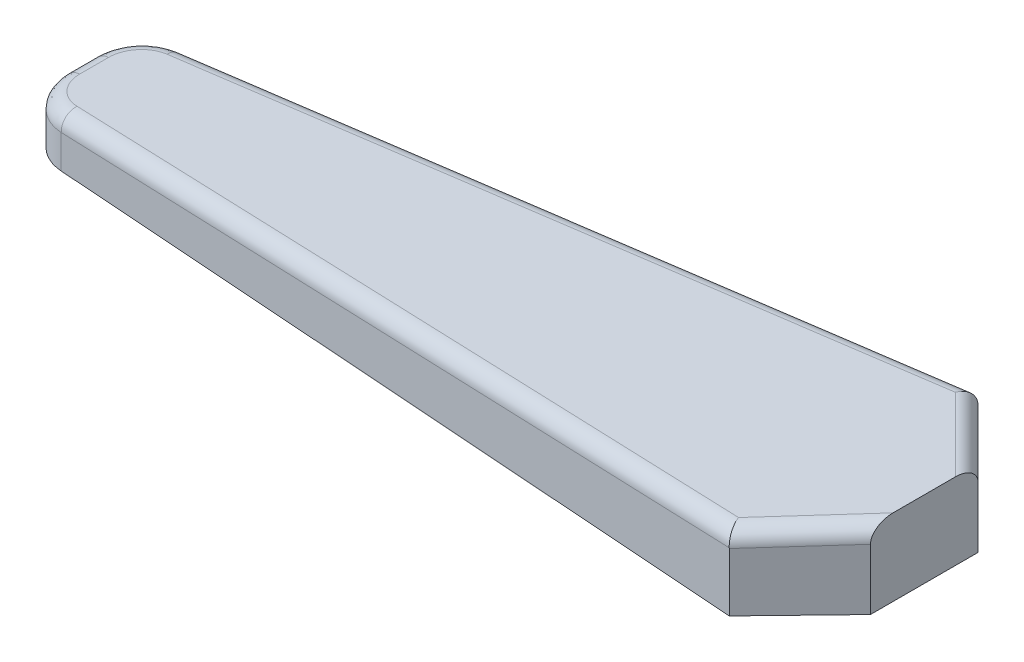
ISO-10303-21;
HEADER;
FILE_DESCRIPTION(('STEP AP214'),'2;1');
FILE_NAME('part.step','',(''),(''),'','','');
FILE_SCHEMA(('AUTOMOTIVE_DESIGN { 1 0 10303 214 1 1 1 1 }'));
ENDSEC;
DATA;
#1=APPLICATION_CONTEXT('core data for automotive mechanical design processes');
#2=APPLICATION_PROTOCOL_DEFINITION('international standard','automotive_design',2000,#1);
#3=PRODUCT_CONTEXT('',#1,'mechanical');
#4=PRODUCT('Part','Part','',(#3));
#5=PRODUCT_RELATED_PRODUCT_CATEGORY('part','',(#4));
#6=PRODUCT_DEFINITION_FORMATION('','',#4);
#7=PRODUCT_DEFINITION_CONTEXT('part definition',#1,'design');
#8=PRODUCT_DEFINITION('design','',#6,#7);
#9=PRODUCT_DEFINITION_SHAPE('','',#8);
#10=(LENGTH_UNIT() NAMED_UNIT(*) SI_UNIT(.MILLI.,.METRE.));
#11=(NAMED_UNIT(*) PLANE_ANGLE_UNIT() SI_UNIT($,.RADIAN.));
#12=(NAMED_UNIT(*) SI_UNIT($,.STERADIAN.) SOLID_ANGLE_UNIT());
#13=UNCERTAINTY_MEASURE_WITH_UNIT(LENGTH_MEASURE(1.E-05),#10,'distance_accuracy_value','');
#14=(GEOMETRIC_REPRESENTATION_CONTEXT(3) GLOBAL_UNCERTAINTY_ASSIGNED_CONTEXT((#13)) GLOBAL_UNIT_ASSIGNED_CONTEXT((#10,
#11,#12)) REPRESENTATION_CONTEXT('',''));
#15=CARTESIAN_POINT('',(0.,0.,0.));
#16=DIRECTION('',(0.,0.,1.));
#17=DIRECTION('',(1.,0.,0.));
#18=AXIS2_PLACEMENT_3D('',#15,#16,#17);
#19=CARTESIAN_POINT('',(0.,-2.5,3.5));
#20=DIRECTION('',(0.707106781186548,0.,0.707106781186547));
#21=DIRECTION('',(0.707106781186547,0.,-0.707106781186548));
#22=AXIS2_PLACEMENT_3D('',#19,#20,#21);
#23=PLANE('',#22);
#24=DIRECTION('',(0.,-1.,0.));
#25=VECTOR('',#24,1.);
#26=CARTESIAN_POINT('',(0.,-2.5,3.5));
#27=LINE('',#26,#25);
#28=CARTESIAN_POINT('',(0.,1.46156975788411,3.5));
#29=VERTEX_POINT('',#28);
#30=CARTESIAN_POINT('',(0.,-2.5,3.5));
#31=VERTEX_POINT('',#30);
#32=EDGE_CURVE('E121',#29,#31,#27,.T.);
#33=ORIENTED_EDGE('',*,*,#32,.F.);
#34=DIRECTION('',(0.706621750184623,0.0370324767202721,-0.706621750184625));
#35=VECTOR('',#34,1.);
#36=CARTESIAN_POINT('',(-0.103666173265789,1.45613684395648,3.60366617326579));
#37=LINE('',#36,#35);
#38=CARTESIAN_POINT('',(-4.5977490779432,1.22061193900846,8.09774907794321));
#39=VERTEX_POINT('',#38);
#40=EDGE_CURVE('E49',#29,#39,#37,.F.);
#41=ORIENTED_EDGE('',*,*,#40,.T.);
#42=DIRECTION('',(0.,1.,0.));
#43=VECTOR('',#42,1.);
#44=CARTESIAN_POINT('',(-4.5977490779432,2.5,8.09774907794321));
#45=LINE('',#44,#43);
#46=CARTESIAN_POINT('',(-4.5977490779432,-2.58025400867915,8.09774907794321));
#47=VERTEX_POINT('',#46);
#48=EDGE_CURVE('E134',#39,#47,#45,.F.);
#49=ORIENTED_EDGE('',*,*,#48,.T.);
#50=DIRECTION('',(0.707052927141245,0.0123416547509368,-0.707052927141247));
#51=VECTOR('',#50,1.);
#52=CARTESIAN_POINT('',(0.,-2.5,3.5));
#53=LINE('',#52,#51);
#54=EDGE_CURVE('E133',#47,#31,#53,.T.);
#55=ORIENTED_EDGE('',*,*,#54,.T.);
#56=EDGE_LOOP('',(#33,#41,#49,#55));
#57=FACE_BOUND('',#56,.T.);
#58=ADVANCED_FACE('F28',(#57),#23,.T.);
#59=CARTESIAN_POINT('',(0.,2.5,3.5));
#60=DIRECTION('',(-0.0523359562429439,0.998629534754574,0.));
#61=DIRECTION('',(-0.998629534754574,-0.052335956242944,0.));
#62=AXIS2_PLACEMENT_3D('',#59,#60,#61);
#63=PLANE('',#62);
#64=DIRECTION('',(0.,0.,1.));
#65=VECTOR('',#64,1.);
#66=CARTESIAN_POINT('',(0.,2.5,3.5));
#67=LINE('',#66,#65);
#68=CARTESIAN_POINT('',(0.,2.5,-2.03345048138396));
#69=VERTEX_POINT('',#68);
#70=CARTESIAN_POINT('',(0.,2.5,2.03345048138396));
#71=VERTEX_POINT('',#70);
#72=EDGE_CURVE('E146',#69,#71,#67,.T.);
#73=ORIENTED_EDGE('',*,*,#72,.F.);
#74=DIRECTION('',(0.706621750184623,0.0370324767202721,0.706621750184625));
#75=VECTOR('',#74,1.);
#76=CARTESIAN_POINT('',(2.76293094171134,2.64479907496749,0.729480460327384));
#77=LINE('',#76,#75);
#78=CARTESIAN_POINT('',(-5.02746250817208,2.23652185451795,-7.06091298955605));
#79=VERTEX_POINT('',#78);
#80=EDGE_CURVE('E193',#69,#79,#77,.F.);
#81=ORIENTED_EDGE('',*,*,#80,.T.);
#82=DIRECTION('',(-0.994839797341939,-0.0521373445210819,0.0870372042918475));
#83=VECTOR('',#82,1.);
#84=CARTESIAN_POINT('',(-52.1749448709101,-0.234372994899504,-2.93604276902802));
#85=LINE('',#84,#83);
#86=CARTESIAN_POINT('',(-52.2266474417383,-0.237082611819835,-2.93151938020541));
#87=VERTEX_POINT('',#86);
#88=EDGE_CURVE('E191',#79,#87,#85,.T.);
#89=ORIENTED_EDGE('',*,*,#88,.T.);
#90=CARTESIAN_POINT('',(-52.0523359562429,-0.227947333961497,-0.939129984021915));
#91=DIRECTION('',(-0.0523359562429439,0.998629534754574,0.));
#92=DIRECTION('',(0.998629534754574,0.052335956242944,0.));
#93=AXIS2_PLACEMENT_3D('',#90,#91,#92);
#94=ELLIPSE('',#93,2.00274469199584,2.);
#95=CARTESIAN_POINT('',(-54.0523359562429,-0.332762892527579,-0.939129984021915));
#96=VERTEX_POINT('',#95);
#97=EDGE_CURVE('E189',#87,#96,#94,.T.);
#98=ORIENTED_EDGE('',*,*,#97,.T.);
#99=DIRECTION('',(0.,0.,-1.));
#100=VECTOR('',#99,1.);
#101=CARTESIAN_POINT('',(-54.0523359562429,-0.332762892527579,0.939129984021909));
#102=LINE('',#101,#100);
#103=CARTESIAN_POINT('',(-54.0523359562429,-0.332762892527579,0.939129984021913));
#104=VERTEX_POINT('',#103);
#105=EDGE_CURVE('E187',#96,#104,#102,.F.);
#106=ORIENTED_EDGE('',*,*,#105,.T.);
#107=CARTESIAN_POINT('',(-52.0523359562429,-0.227947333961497,0.939129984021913));
#108=DIRECTION('',(-0.0523359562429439,0.998629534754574,0.));
#109=DIRECTION('',(-0.998629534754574,-0.052335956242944,0.));
#110=AXIS2_PLACEMENT_3D('',#107,#108,#109);
#111=ELLIPSE('',#110,2.00274469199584,2.);
#112=CARTESIAN_POINT('',(-52.2266474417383,-0.237082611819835,2.9315193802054));
#113=VERTEX_POINT('',#112);
#114=EDGE_CURVE('E185',#104,#113,#111,.T.);
#115=ORIENTED_EDGE('',*,*,#114,.T.);
#116=DIRECTION('',(-0.994839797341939,-0.0521373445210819,-0.0870372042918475));
#117=VECTOR('',#116,1.);
#118=CARTESIAN_POINT('',(-4.51122672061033,2.2635766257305,7.10607776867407));
#119=LINE('',#118,#117);
#120=CARTESIAN_POINT('',(-5.02746250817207,2.23652185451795,7.06091298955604));
#121=VERTEX_POINT('',#120);
#122=EDGE_CURVE('E181',#113,#121,#119,.F.);
#123=ORIENTED_EDGE('',*,*,#122,.T.);
#124=DIRECTION('',(0.706621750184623,0.0370324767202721,-0.706621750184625));
#125=VECTOR('',#124,1.);
#126=CARTESIAN_POINT('',(-0.732269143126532,2.46162340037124,2.76571962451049));
#127=LINE('',#126,#125);
#128=EDGE_CURVE('E183',#121,#71,#127,.T.);
#129=ORIENTED_EDGE('',*,*,#128,.T.);
#130=EDGE_LOOP('',(#73,#81,#89,#98,#106,#115,#123,#129));
#131=FACE_BOUND('',#130,.T.);
#132=ADVANCED_FACE('F257',(#131),#63,.T.);
#133=CARTESIAN_POINT('',(0.,-2.5,-3.5));
#134=DIRECTION('',(0.707106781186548,0.,-0.707106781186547));
#135=DIRECTION('',(-0.707106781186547,0.,-0.707106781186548));
#136=AXIS2_PLACEMENT_3D('',#133,#134,#135);
#137=PLANE('',#136);
#138=DIRECTION('',(0.,-1.,0.));
#139=VECTOR('',#138,1.);
#140=CARTESIAN_POINT('',(-4.5977490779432,2.5,-8.09774907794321));
#141=LINE('',#140,#139);
#142=CARTESIAN_POINT('',(-4.5977490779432,-2.58025400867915,-8.09774907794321));
#143=VERTEX_POINT('',#142);
#144=CARTESIAN_POINT('',(-4.5977490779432,1.22061193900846,-8.09774907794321));
#145=VERTEX_POINT('',#144);
#146=EDGE_CURVE('E139',#143,#145,#141,.F.);
#147=ORIENTED_EDGE('',*,*,#146,.T.);
#148=DIRECTION('',(0.706621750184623,0.0370324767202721,0.706621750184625));
#149=VECTOR('',#148,1.);
#150=CARTESIAN_POINT('',(-0.103666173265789,1.45613684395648,-3.60366617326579));
#151=LINE('',#150,#149);
#152=CARTESIAN_POINT('',(0.,1.46156975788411,-3.5));
#153=VERTEX_POINT('',#152);
#154=EDGE_CURVE('E201',#145,#153,#151,.T.);
#155=ORIENTED_EDGE('',*,*,#154,.T.);
#156=DIRECTION('',(0.,1.,0.));
#157=VECTOR('',#156,1.);
#158=CARTESIAN_POINT('',(0.,-2.5,-3.5));
#159=LINE('',#158,#157);
#160=CARTESIAN_POINT('',(0.,-2.5,-3.5));
#161=VERTEX_POINT('',#160);
#162=EDGE_CURVE('E144',#161,#153,#159,.T.);
#163=ORIENTED_EDGE('',*,*,#162,.F.);
#164=DIRECTION('',(0.707052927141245,0.0123416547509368,0.707052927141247));
#165=VECTOR('',#164,1.);
#166=CARTESIAN_POINT('',(3.49946689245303,-2.43891657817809,-0.000533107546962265));
#167=LINE('',#166,#165);
#168=EDGE_CURVE('E138',#143,#161,#167,.T.);
#169=ORIENTED_EDGE('',*,*,#168,.F.);
#170=EDGE_LOOP('',(#147,#155,#163,#169));
#171=FACE_BOUND('',#170,.T.);
#172=ADVANCED_FACE('F299',(#171),#137,.T.);
#173=CARTESIAN_POINT('',(0.,-2.5,3.5));
#174=DIRECTION('',(0.0174524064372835,-0.999847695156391,0.));
#175=DIRECTION('',(0.999847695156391,0.0174524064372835,0.));
#176=AXIS2_PLACEMENT_3D('',#173,#174,#175);
#177=PLANE('',#176);
#178=DIRECTION('',(0.,0.,1.));
#179=VECTOR('',#178,1.);
#180=CARTESIAN_POINT('',(-55.,-3.46002857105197,3.5));
#181=LINE('',#180,#179);
#182=CARTESIAN_POINT('',(-55.,-3.46002857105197,-0.939129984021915));
#183=VERTEX_POINT('',#182);
#184=CARTESIAN_POINT('',(-55.,-3.46002857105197,0.939129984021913));
#185=VERTEX_POINT('',#184);
#186=EDGE_CURVE('E158',#183,#185,#181,.T.);
#187=ORIENTED_EDGE('',*,*,#186,.F.);
#188=CARTESIAN_POINT('',(-52.,-3.40766337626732,-0.939129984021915));
#189=DIRECTION('',(0.0174524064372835,-0.999847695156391,0.));
#190=DIRECTION('',(0.999847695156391,0.0174524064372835,0.));
#191=AXIS2_PLACEMENT_3D('',#188,#189,#190);
#192=ELLIPSE('',#191,3.00045698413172,3.);
#193=CARTESIAN_POINT('',(-52.261467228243,-3.4122273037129,-3.92771407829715));
#194=VERTEX_POINT('',#193);
#195=EDGE_CURVE('E169',#183,#194,#192,.T.);
#196=ORIENTED_EDGE('',*,*,#195,.T.);
#197=DIRECTION('',(-0.996044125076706,-0.0173860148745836,0.0871425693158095));
#198=VECTOR('',#197,1.);
#199=CARTESIAN_POINT('',(0.0865861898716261,-2.49848863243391,-8.50757531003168));
#200=LINE('',#199,#198);
#201=EDGE_CURVE('E130',#194,#143,#200,.F.);
#202=ORIENTED_EDGE('',*,*,#201,.T.);
#203=ORIENTED_EDGE('',*,*,#168,.T.);
#204=DIRECTION('',(0.,0.,-1.));
#205=VECTOR('',#204,1.);
#206=CARTESIAN_POINT('',(0.,-2.5,3.5));
#207=LINE('',#206,#205);
#208=EDGE_CURVE('E126',#31,#161,#207,.T.);
#209=ORIENTED_EDGE('',*,*,#208,.F.);
#210=ORIENTED_EDGE('',*,*,#54,.F.);
#211=DIRECTION('',(-0.996044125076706,-0.0173860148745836,-0.0871425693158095));
#212=VECTOR('',#211,1.);
#213=CARTESIAN_POINT('',(-0.433989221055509,-2.50757531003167,8.46203086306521));
#214=LINE('',#213,#212);
#215=CARTESIAN_POINT('',(-52.261467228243,-3.4122273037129,3.92771407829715));
#216=VERTEX_POINT('',#215);
#217=EDGE_CURVE('E157',#216,#47,#214,.F.);
#218=ORIENTED_EDGE('',*,*,#217,.F.);
#219=CARTESIAN_POINT('',(-52.,-3.40766337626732,0.939129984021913));
#220=DIRECTION('',(0.0174524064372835,-0.999847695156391,0.));
#221=DIRECTION('',(-0.999847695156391,-0.0174524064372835,0.));
#222=AXIS2_PLACEMENT_3D('',#219,#220,#221);
#223=ELLIPSE('',#222,3.00045698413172,3.);
#224=EDGE_CURVE('E167',#216,#185,#223,.T.);
#225=ORIENTED_EDGE('',*,*,#224,.T.);
#226=EDGE_LOOP('',(#187,#196,#202,#203,#209,#210,#218,#225));
#227=FACE_BOUND('',#226,.T.);
#228=ADVANCED_FACE('F30',(#227),#177,.T.);
#229=CARTESIAN_POINT('',(0.,2.5,3.5));
#230=DIRECTION('',(-1.,0.,0.));
#231=DIRECTION('',(0.,0.,1.));
#232=AXIS2_PLACEMENT_3D('',#229,#230,#231);
#233=PLANE('',#232);
#234=ORIENTED_EDGE('',*,*,#162,.T.);
#235=CARTESIAN_POINT('',(0.,1.49862765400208,-2.0857864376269));
#236=DIRECTION('',(-1.,0.,0.));
#237=DIRECTION('',(0.,0.0523359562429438,0.998629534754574));
#238=AXIS2_PLACEMENT_3D('',#235,#236,#237);
#239=ELLIPSE('',#238,1.41518429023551,1.);
#240=EDGE_CURVE('E204',#153,#69,#239,.F.);
#241=ORIENTED_EDGE('',*,*,#240,.T.);
#242=ORIENTED_EDGE('',*,*,#72,.T.);
#243=CARTESIAN_POINT('',(0.,1.49862765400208,2.0857864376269));
#244=DIRECTION('',(-1.,0.,0.));
#245=DIRECTION('',(0.,0.0523359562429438,-0.998629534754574));
#246=AXIS2_PLACEMENT_3D('',#243,#244,#245);
#247=ELLIPSE('',#246,1.41518429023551,1.);
#248=EDGE_CURVE('E129',#71,#29,#247,.F.);
#249=ORIENTED_EDGE('',*,*,#248,.T.);
#250=ORIENTED_EDGE('',*,*,#32,.T.);
#251=ORIENTED_EDGE('',*,*,#208,.T.);
#252=EDGE_LOOP('',(#234,#241,#242,#249,#250,#251));
#253=FACE_BOUND('',#252,.T.);
#254=ADVANCED_FACE('F124',(#253),#233,.F.);
#255=CARTESIAN_POINT('',(0.,2.5,-8.50000000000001));
#256=DIRECTION('',(-0.0871557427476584,0.,-0.996194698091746));
#257=DIRECTION('',(-0.996194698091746,0.,0.0871557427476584));
#258=AXIS2_PLACEMENT_3D('',#255,#256,#257);
#259=PLANE('',#258);
#260=DIRECTION('',(0.,-1.,0.));
#261=VECTOR('',#260,1.);
#262=CARTESIAN_POINT('',(-52.261467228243,2.5,-3.92771407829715));
#263=LINE('',#262,#261);
#264=CARTESIAN_POINT('',(-52.261467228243,-1.23571214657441,-3.92771407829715));
#265=VERTEX_POINT('',#264);
#266=EDGE_CURVE('E171',#194,#265,#263,.F.);
#267=ORIENTED_EDGE('',*,*,#266,.T.);
#268=DIRECTION('',(0.994839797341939,0.0521373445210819,-0.0870372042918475));
#269=VECTOR('',#268,1.);
#270=CARTESIAN_POINT('',(-4.54604650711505,1.26494709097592,-8.10227246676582));
#271=LINE('',#270,#269);
#272=CARTESIAN_POINT('',(-4.5988729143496,1.26217857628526,-8.097650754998));
#273=VERTEX_POINT('',#272);
#274=EDGE_CURVE('E178',#265,#273,#271,.T.);
#275=ORIENTED_EDGE('',*,*,#274,.T.);
#276=CARTESIAN_POINT('',(-5.89818889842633,1.18951667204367,-7.98397533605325));
#277=DIRECTION('',(-0.0871557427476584,0.,-0.996194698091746));
#278=DIRECTION('',(0.994543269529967,0.0575562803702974,-0.0870112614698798));
#279=AXIS2_PLACEMENT_3D('',#276,#277,#278);
#280=ELLIPSE('',#279,1.30630333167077,1.);
#281=EDGE_CURVE('E176',#273,#145,#280,.T.);
#282=ORIENTED_EDGE('',*,*,#281,.T.);
#283=ORIENTED_EDGE('',*,*,#146,.F.);
#284=ORIENTED_EDGE('',*,*,#201,.F.);
#285=EDGE_LOOP('',(#267,#275,#282,#283,#284));
#286=FACE_BOUND('',#285,.T.);
#287=ADVANCED_FACE('F293',(#286),#259,.T.);
#288=CARTESIAN_POINT('',(0.,2.5,8.50000000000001));
#289=DIRECTION('',(-0.0871557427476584,0.,0.996194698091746));
#290=DIRECTION('',(0.996194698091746,0.,0.0871557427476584));
#291=AXIS2_PLACEMENT_3D('',#288,#289,#290);
#292=PLANE('',#291);
#293=ORIENTED_EDGE('',*,*,#48,.F.);
#294=CARTESIAN_POINT('',(-5.89818889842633,1.18951667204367,7.98397533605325));
#295=DIRECTION('',(-0.0871557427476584,0.,0.996194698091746));
#296=DIRECTION('',(0.994543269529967,0.0575562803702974,0.0870112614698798));
#297=AXIS2_PLACEMENT_3D('',#294,#295,#296);
#298=ELLIPSE('',#297,1.30630333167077,1.);
#299=CARTESIAN_POINT('',(-4.59887291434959,1.26217857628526,8.09765075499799));
#300=VERTEX_POINT('',#299);
#301=EDGE_CURVE('E11',#39,#300,#298,.T.);
#302=ORIENTED_EDGE('',*,*,#301,.T.);
#303=DIRECTION('',(0.994839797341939,0.0521373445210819,0.0870372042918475));
#304=VECTOR('',#303,1.);
#305=CARTESIAN_POINT('',(-52.2097646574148,-1.23300252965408,3.93223746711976));
#306=LINE('',#305,#304);
#307=CARTESIAN_POINT('',(-52.261467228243,-1.23571214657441,3.92771407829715));
#308=VERTEX_POINT('',#307);
#309=EDGE_CURVE('E36',#300,#308,#306,.F.);
#310=ORIENTED_EDGE('',*,*,#309,.T.);
#311=DIRECTION('',(0.,1.,0.));
#312=VECTOR('',#311,1.);
#313=CARTESIAN_POINT('',(-52.261467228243,2.5,3.92771407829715));
#314=LINE('',#313,#312);
#315=EDGE_CURVE('E174',#308,#216,#314,.F.);
#316=ORIENTED_EDGE('',*,*,#315,.T.);
#317=ORIENTED_EDGE('',*,*,#217,.T.);
#318=EDGE_LOOP('',(#293,#302,#310,#316,#317));
#319=FACE_BOUND('',#318,.T.);
#320=ADVANCED_FACE('F208',(#319),#292,.T.);
#321=CARTESIAN_POINT('',(-55.,2.5,-8.50000000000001));
#322=DIRECTION('',(1.,0.,0.));
#323=DIRECTION('',(0.,0.,-1.));
#324=AXIS2_PLACEMENT_3D('',#321,#322,#323);
#325=PLANE('',#324);
#326=DIRECTION('',(0.,-1.,0.));
#327=VECTOR('',#326,1.);
#328=CARTESIAN_POINT('',(-55.,2.5,0.939129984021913));
#329=LINE('',#328,#327);
#330=CARTESIAN_POINT('',(-55.,-1.33139242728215,0.939129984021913));
#331=VERTEX_POINT('',#330);
#332=EDGE_CURVE('E155',#185,#331,#329,.F.);
#333=ORIENTED_EDGE('',*,*,#332,.T.);
#334=DIRECTION('',(0.,0.,-1.));
#335=VECTOR('',#334,1.);
#336=CARTESIAN_POINT('',(-55.,-1.33139242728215,-0.939129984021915));
#337=LINE('',#336,#335);
#338=CARTESIAN_POINT('',(-55.,-1.33139242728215,-0.939129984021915));
#339=VERTEX_POINT('',#338);
#340=EDGE_CURVE('E197',#331,#339,#337,.T.);
#341=ORIENTED_EDGE('',*,*,#340,.T.);
#342=DIRECTION('',(0.,1.,0.));
#343=VECTOR('',#342,1.);
#344=CARTESIAN_POINT('',(-55.,2.5,-0.939129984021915));
#345=LINE('',#344,#343);
#346=EDGE_CURVE('E165',#339,#183,#345,.F.);
#347=ORIENTED_EDGE('',*,*,#346,.T.);
#348=ORIENTED_EDGE('',*,*,#186,.T.);
#349=EDGE_LOOP('',(#333,#341,#347,#348));
#350=FACE_BOUND('',#349,.T.);
#351=ADVANCED_FACE('F239',(#350),#325,.F.);
#352=CARTESIAN_POINT('',(-52.,2.5,-0.939129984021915));
#353=DIRECTION('',(0.,1.,0.));
#354=DIRECTION('',(0.,0.,1.));
#355=AXIS2_PLACEMENT_3D('',#352,#353,#354);
#356=CYLINDRICAL_SURFACE('',#355,3.);
#357=ORIENTED_EDGE('',*,*,#346,.F.);
#358=CARTESIAN_POINT('',(-52.,-1.22657686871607,-0.939129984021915));
#359=DIRECTION('',(0.0349172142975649,-0.999390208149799,0.));
#360=DIRECTION('',(0.999390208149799,0.0349172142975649,0.));
#361=AXIS2_PLACEMENT_3D('',#358,#359,#360);
#362=ELLIPSE('',#361,3.00183049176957,3.);
#363=EDGE_CURVE('E195',#339,#265,#362,.T.);
#364=ORIENTED_EDGE('',*,*,#363,.T.);
#365=ORIENTED_EDGE('',*,*,#266,.F.);
#366=ORIENTED_EDGE('',*,*,#195,.F.);
#367=EDGE_LOOP('',(#357,#364,#365,#366));
#368=FACE_BOUND('',#367,.T.);
#369=ADVANCED_FACE('F242',(#368),#356,.T.);
#370=CARTESIAN_POINT('',(-52.,2.5,0.939129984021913));
#371=DIRECTION('',(0.,-1.,0.));
#372=DIRECTION('',(0.,0.,-1.));
#373=AXIS2_PLACEMENT_3D('',#370,#371,#372);
#374=CYLINDRICAL_SURFACE('',#373,3.);
#375=ORIENTED_EDGE('',*,*,#315,.F.);
#376=CARTESIAN_POINT('',(-52.,-1.22657686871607,0.939129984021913));
#377=DIRECTION('',(0.0349172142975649,-0.999390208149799,0.));
#378=DIRECTION('',(-0.999390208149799,-0.0349172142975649,0.));
#379=AXIS2_PLACEMENT_3D('',#376,#377,#378);
#380=ELLIPSE('',#379,3.00183049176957,3.);
#381=EDGE_CURVE('E199',#308,#331,#380,.T.);
#382=ORIENTED_EDGE('',*,*,#381,.T.);
#383=ORIENTED_EDGE('',*,*,#332,.F.);
#384=ORIENTED_EDGE('',*,*,#224,.F.);
#385=EDGE_LOOP('',(#375,#382,#383,#384));
#386=FACE_BOUND('',#385,.T.);
#387=ADVANCED_FACE('F214',(#386),#374,.T.);
#388=CARTESIAN_POINT('',(-0.679933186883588,1.46299386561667,2.76571962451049));
#389=DIRECTION('',(0.706621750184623,0.0370324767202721,-0.706621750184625));
#390=DIRECTION('',(-0.707106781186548,0.,-0.707106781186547));
#391=AXIS2_PLACEMENT_3D('',#388,#389,#390);
#392=CYLINDRICAL_SURFACE('',#391,1.);
#393=ORIENTED_EDGE('',*,*,#248,.F.);
#394=ORIENTED_EDGE('',*,*,#128,.F.);
#395=CARTESIAN_POINT('',(-4.97512655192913,1.23789231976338,7.06091298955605));
#396=DIRECTION('',(0.938501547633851,0.0491847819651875,-0.341753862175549));
#397=DIRECTION('',(0.341285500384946,0.0178860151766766,0.939789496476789));
#398=AXIS2_PLACEMENT_3D('',#395,#396,#397);
#399=ELLIPSE('',#398,1.10317103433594,1.);
#400=EDGE_CURVE('E161',#300,#121,#399,.F.);
#401=ORIENTED_EDGE('',*,*,#400,.F.);
#402=ORIENTED_EDGE('',*,*,#301,.F.);
#403=ORIENTED_EDGE('',*,*,#40,.F.);
#404=EDGE_LOOP('',(#393,#394,#401,#402,#403));
#405=FACE_BOUND('',#404,.T.);
#406=ADVANCED_FACE('F246',(#405),#392,.T.);
#407=CARTESIAN_POINT('',(-0.294082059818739,1.48321546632,7.47045131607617));
#408=DIRECTION('',(0.994839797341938,0.0521373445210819,0.0870372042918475));
#409=DIRECTION('',(0.0871557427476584,0.,-0.996194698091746));
#410=AXIS2_PLACEMENT_3D('',#407,#408,#409);
#411=CYLINDRICAL_SURFACE('',#410,1.);
#412=ORIENTED_EDGE('',*,*,#400,.T.);
#413=ORIENTED_EDGE('',*,*,#122,.F.);
#414=CARTESIAN_POINT('',(-52.1743114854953,-1.23571214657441,2.9315193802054));
#415=DIRECTION('',(-0.994839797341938,-0.0521373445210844,-0.0870372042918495));
#416=DIRECTION('',(-0.0871557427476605,0.,0.996194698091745));
#417=AXIS2_PLACEMENT_3D('',#414,#415,#416);
#418=CIRCLE('',#417,1.);
#419=EDGE_CURVE('E219',#308,#113,#418,.T.);
#420=ORIENTED_EDGE('',*,*,#419,.F.);
#421=ORIENTED_EDGE('',*,*,#309,.F.);
#422=EDGE_LOOP('',(#412,#413,#420,#421));
#423=FACE_BOUND('',#422,.T.);
#424=ADVANCED_FACE('F220',(#423),#411,.T.);
#425=CARTESIAN_POINT('',(-55.,-1.33139242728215,0.939129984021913));
#426=CARTESIAN_POINT('',(-55.,-0.382427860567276,0.939129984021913));
#427=CARTESIAN_POINT('',(-54.0523359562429,-0.332762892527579,0.939129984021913));
#428=CARTESIAN_POINT('',(-55.,-1.33139242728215,1.07003048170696));
#429=CARTESIAN_POINT('',(-55.,-0.382427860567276,1.06786042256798));
#430=CARTESIAN_POINT('',(-54.0523359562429,-0.332762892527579,1.02639698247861));
#431=CARTESIAN_POINT('',(-54.9914201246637,-1.33109265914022,1.20093097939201));
#432=CARTESIAN_POINT('',(-54.9917033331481,-0.381993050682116,1.19660917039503));
#433=CARTESIAN_POINT('',(-54.046616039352,-0.332463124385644,1.11366398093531));
#434=CARTESIAN_POINT('',(-54.957248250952,-1.32989874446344,1.46049216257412));
#435=CARTESIAN_POINT('',(-54.9586557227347,-0.380261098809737,1.45197269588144));
#436=CARTESIAN_POINT('',(-54.023834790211,-0.331269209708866,1.28670476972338));
#437=CARTESIAN_POINT('',(-54.931655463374,-1.32900457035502,1.58915274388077));
#438=CARTESIAN_POINT('',(-54.9338946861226,-0.378963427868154,1.57862281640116));
#439=CARTESIAN_POINT('',(-54.0067729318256,-0.330375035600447,1.37247849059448));
#440=CARTESIAN_POINT('',(-54.8638964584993,-1.32663717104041,1.84203282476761));
#441=CARTESIAN_POINT('',(-54.8683131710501,-0.375526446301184,1.82772388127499));
#442=CARTESIAN_POINT('',(-53.9616002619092,-0.32800763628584,1.54106521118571));
#443=CARTESIAN_POINT('',(-54.8217287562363,-1.3251638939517,1.96625192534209));
#444=CARTESIAN_POINT('',(-54.8274731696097,-0.37338611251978,1.95020642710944));
#445=CARTESIAN_POINT('',(-53.9334884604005,-0.326534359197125,1.62387794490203));
#446=CARTESIAN_POINT('',(-54.7215420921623,-1.3216635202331,2.20812395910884));
#447=CARTESIAN_POINT('',(-54.730379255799,-0.36829763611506,2.18896850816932));
#448=CARTESIAN_POINT('',(-53.8666973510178,-0.323033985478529,1.78512596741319));
#449=CARTESIAN_POINT('',(-54.6635211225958,-1.31963635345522,2.32577605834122));
#450=CARTESIAN_POINT('',(-54.6740976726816,-0.365348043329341,2.30527368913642));
#451=CARTESIAN_POINT('',(-53.8280167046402,-0.321006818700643,1.86356070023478));
#452=CARTESIAN_POINT('',(-54.532621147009,-1.31506290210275,2.55250149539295));
#453=CARTESIAN_POINT('',(-54.5470088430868,-0.358687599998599,2.52976724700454));
#454=CARTESIAN_POINT('',(-53.740750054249,-0.316433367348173,2.0147109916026));
#455=CARTESIAN_POINT('',(-54.4597398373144,-1.31251653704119,2.66157349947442));
#456=CARTESIAN_POINT('',(-54.4761675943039,-0.354974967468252,2.63797349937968));
#457=CARTESIAN_POINT('',(-53.6921625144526,-0.313887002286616,2.08742566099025));
#458=CARTESIAN_POINT('',(-54.3003664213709,-1.30694826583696,2.86927300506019));
#459=CARTESIAN_POINT('',(-54.3210795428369,-0.346847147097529,2.84447337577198));
#460=CARTESIAN_POINT('',(-53.5859135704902,-0.308318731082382,2.22589199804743));
#461=CARTESIAN_POINT('',(-54.2138719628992,-1.30392627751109,2.96789869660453));
#462=CARTESIAN_POINT('',(-54.2367946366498,-0.342429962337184,2.94277581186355));
#463=CARTESIAN_POINT('',(-53.5282505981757,-0.305296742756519,2.29164245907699));
#464=CARTESIAN_POINT('',(-54.0287521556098,-1.2974584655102,3.15301852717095));
#465=CARTESIAN_POINT('',(-54.0561575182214,-0.332963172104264,3.12781719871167));
#466=CARTESIAN_POINT('',(-53.4048373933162,-0.298828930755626,2.41505567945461));
#467=CARTESIAN_POINT('',(-53.9301246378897,-1.29401256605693,3.23951049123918));
#468=CARTESIAN_POINT('',(-53.9597655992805,-0.32791148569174,3.21455521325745));
#469=CARTESIAN_POINT('',(-53.3390857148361,-0.295383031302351,2.47271698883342));
#470=CARTESIAN_POINT('',(-53.7224259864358,-1.28675588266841,3.39888329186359));
#471=CARTESIAN_POINT('',(-53.7564542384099,-0.317256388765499,3.3749877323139));
#472=CARTESIAN_POINT('',(-53.2006199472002,-0.288126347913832,2.57896552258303));
#473=CARTESIAN_POINT('',(-53.6133530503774,-1.2829450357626,3.47176177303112));
#474=CARTESIAN_POINT('',(-53.6494960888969,-0.311650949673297,3.44867152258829));
#475=CARTESIAN_POINT('',(-53.1279046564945,-0.284315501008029,2.62755117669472));
#476=CARTESIAN_POINT('',(-53.3866293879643,-1.27502364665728,3.60266075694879));
#477=CARTESIAN_POINT('',(-53.4267740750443,-0.299978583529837,3.58171090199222));
#478=CARTESIAN_POINT('',(-52.9767555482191,-0.276394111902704,2.71481716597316));
#479=CARTESIAN_POINT('',(-53.2689773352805,-1.27091305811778,3.66067895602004));
#480=CARTESIAN_POINT('',(-53.3109750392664,-0.293909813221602,3.64104662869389));
#481=CARTESIAN_POINT('',(-52.8983208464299,-0.272283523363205,2.753495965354));
#482=CARTESIAN_POINT('',(-53.0271079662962,-1.26246250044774,3.76086454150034));
#483=CARTESIAN_POINT('',(-53.072452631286,-0.281409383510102,3.7443233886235));
#484=CARTESIAN_POINT('',(-52.7370746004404,-0.263832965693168,2.8202863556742));
#485=CARTESIAN_POINT('',(-52.9028898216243,-1.25812250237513,3.80302992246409));
#486=CARTESIAN_POINT('',(-52.9496999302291,-0.274976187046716,3.78823666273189));
#487=CARTESIAN_POINT('',(-52.6542625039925,-0.259492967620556,2.84839660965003));
#488=CARTESIAN_POINT('',(-52.6500131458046,-1.24928736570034,3.87078803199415));
#489=CARTESIAN_POINT('',(-52.6992857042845,-0.26185253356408,3.85984112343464));
#490=CARTESIAN_POINT('',(-52.485678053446,-0.250657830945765,2.89356868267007));
#491=CARTESIAN_POINT('',(-52.5213542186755,-1.24479221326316,3.89637927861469));
#492=CARTESIAN_POINT('',(-52.5716026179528,-0.255160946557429,3.88749844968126));
#493=CARTESIAN_POINT('',(-52.3999054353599,-0.246162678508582,2.91062951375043));
#494=CARTESIAN_POINT('',(-52.2617969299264,-1.23572366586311,3.93055064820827));
#495=CARTESIAN_POINT('',(-52.3134488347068,-0.24163168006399,3.92602125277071));
#496=CARTESIAN_POINT('',(-52.2268672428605,-0.237094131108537,2.93341042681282));
#497=CARTESIAN_POINT('',(-52.1308984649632,-1.23115026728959,3.93912998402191));
#498=CARTESIAN_POINT('',(-52.1829657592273,-0.234793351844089,3.93684899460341));
#499=CARTESIAN_POINT('',(-52.1396015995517,-0.232520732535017,2.93912998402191));
#500=CARTESIAN_POINT('',(-51.8691015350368,-1.22200347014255,3.93912998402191));
#501=CARTESIAN_POINT('',(-51.9214075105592,-0.221085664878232,3.94141618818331));
#502=CARTESIAN_POINT('',(-51.9650703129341,-0.223373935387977,2.93912998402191));
#503=CARTESIAN_POINT('',(-51.7382030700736,-1.21743007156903,3.93055064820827));
#504=CARTESIAN_POINT('',(-51.7903299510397,-0.214216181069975,3.93511654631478));
#505=CARTESIAN_POINT('',(-51.8778046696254,-0.218800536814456,2.93341042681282));
#506=CARTESIAN_POINT('',(-51.4786457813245,-1.20836152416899,3.89637927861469));
#507=CARTESIAN_POINT('',(-51.5298182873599,-0.200563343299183,3.90541813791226));
#508=CARTESIAN_POINT('',(-51.7047664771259,-0.209731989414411,2.91062951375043));
#509=CARTESIAN_POINT('',(-51.3499868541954,-1.2038663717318,3.87078803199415));
#510=CARTESIAN_POINT('',(-51.4003919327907,-0.193780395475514,3.88198156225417));
#511=CARTESIAN_POINT('',(-51.6189938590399,-0.205236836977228,2.89356868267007));
#512=CARTESIAN_POINT('',(-51.0971101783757,-1.19503123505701,3.80302992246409));
#513=CARTESIAN_POINT('',(-51.1454213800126,-0.180417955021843,3.81829230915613));
#514=CARTESIAN_POINT('',(-51.4504094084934,-0.196401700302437,2.84839660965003));
#515=CARTESIAN_POINT('',(-50.9728920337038,-1.1906912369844,3.76086454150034));
#516=CARTESIAN_POINT('',(-51.0198945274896,-0.173839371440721,3.77800570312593));
#517=CARTESIAN_POINT('',(-51.3675973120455,-0.192061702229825,2.8202863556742));
#518=CARTESIAN_POINT('',(-50.7310226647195,-1.18224067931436,3.66067895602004));
#519=CARTESIAN_POINT('',(-50.7749256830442,-0.161001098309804,3.68119681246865));
#520=CARTESIAN_POINT('',(-51.2063510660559,-0.183611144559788,2.753495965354));
#521=CARTESIAN_POINT('',(-50.6133706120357,-1.17813009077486,3.60266075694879));
#522=CARTESIAN_POINT('',(-50.655509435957,-0.15474275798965,3.62464685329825));
#523=CARTESIAN_POINT('',(-51.1279163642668,-0.17950055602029,2.71481716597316));
#524=CARTESIAN_POINT('',(-50.3866469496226,-1.17020870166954,3.47176177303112));
#525=CARTESIAN_POINT('',(-50.4248876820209,-0.142656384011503,3.49618723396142));
#526=CARTESIAN_POINT('',(-50.9767672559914,-0.171579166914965,2.62755117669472));
#527=CARTESIAN_POINT('',(-50.2775740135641,-1.16639785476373,3.39888329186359));
#528=CARTESIAN_POINT('',(-50.3137145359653,-0.136830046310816,3.42425813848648));
#529=CARTESIAN_POINT('',(-50.9040519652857,-0.167768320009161,2.57896552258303));
#530=CARTESIAN_POINT('',(-50.0698753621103,-1.15914117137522,3.23951049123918));
#531=CARTESIAN_POINT('',(-50.1015863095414,-0.125712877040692,3.26620391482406));
#532=CARTESIAN_POINT('',(-50.7655861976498,-0.160511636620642,2.47271698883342));
#533=CARTESIAN_POINT('',(-49.9712478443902,-1.15569527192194,3.15301852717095));
#534=CARTESIAN_POINT('',(-50.0006679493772,-0.120423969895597,3.18006904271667));
#535=CARTESIAN_POINT('',(-50.6998345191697,-0.157065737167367,2.41505567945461));
#536=CARTESIAN_POINT('',(-49.7861280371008,-1.14922745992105,2.96789869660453));
#537=CARTESIAN_POINT('',(-49.8108964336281,-0.11047846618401,2.99504023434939));
#538=CARTESIAN_POINT('',(-50.5764213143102,-0.150597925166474,2.29164245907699));
#539=CARTESIAN_POINT('',(-49.6996335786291,-1.14620547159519,2.86927300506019));
#540=CARTESIAN_POINT('',(-49.7220817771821,-0.105823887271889,2.89614705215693));
#541=CARTESIAN_POINT('',(-50.5187583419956,-0.147575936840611,2.22589199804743));
#542=CARTESIAN_POINT('',(-49.5402601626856,-1.14063720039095,2.66157349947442));
#543=CARTESIAN_POINT('',(-49.5581642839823,-0.0972333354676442,2.68729066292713));
#544=CARTESIAN_POINT('',(-50.4125093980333,-0.142007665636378,2.08742566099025));
#545=CARTESIAN_POINT('',(-49.4673788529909,-1.13809083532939,2.55250149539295));
#546=CARTESIAN_POINT('',(-49.4830989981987,-0.0932993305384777,2.57733879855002));
#547=CARTESIAN_POINT('',(-50.3639218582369,-0.139461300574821,2.0147109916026));
#548=CARTESIAN_POINT('',(-49.3364788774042,-1.13351738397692,2.32577605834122));
#549=CARTESIAN_POINT('',(-49.3480886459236,-0.0862237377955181,2.34827804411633));
#550=CARTESIAN_POINT('',(-50.2766552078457,-0.13488784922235,1.86356070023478));
#551=CARTESIAN_POINT('',(-49.2784579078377,-1.13149021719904,2.20812395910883));
#552=CARTESIAN_POINT('',(-49.2881775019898,-0.083083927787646,2.22919043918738));
#553=CARTESIAN_POINT('',(-50.2379745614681,-0.132860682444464,1.78512596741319));
#554=CARTESIAN_POINT('',(-49.1782712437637,-1.12798984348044,1.96625192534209));
#555=CARTESIAN_POINT('',(-49.1846119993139,-0.0776562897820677,1.98396045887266));
#556=CARTESIAN_POINT('',(-50.1711834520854,-0.129360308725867,1.62387794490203));
#557=CARTESIAN_POINT('',(-49.1361035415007,-1.12651656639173,1.84203282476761));
#558=CARTESIAN_POINT('',(-49.1409854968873,-0.0753699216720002,1.85784796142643));
#559=CARTESIAN_POINT('',(-50.1430716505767,-0.127887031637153,1.54106521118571));
#560=CARTESIAN_POINT('',(-49.068344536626,-1.12414916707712,1.58915274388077));
#561=CARTESIAN_POINT('',(-49.0708258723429,-0.0716930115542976,1.60081906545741));
#562=CARTESIAN_POINT('',(-50.0978989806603,-0.125519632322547,1.37247849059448));
#563=CARTESIAN_POINT('',(-49.042751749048,-1.1232549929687,1.46049216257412));
#564=CARTESIAN_POINT('',(-49.0443125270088,-0.0703035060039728,1.46993917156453));
#565=CARTESIAN_POINT('',(-50.0808371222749,-0.124625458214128,1.28670476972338));
#566=CARTESIAN_POINT('',(-49.0085798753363,-1.12206107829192,1.20093097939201));
#567=CARTESIAN_POINT('',(-49.0088944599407,-0.068447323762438,1.2057294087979));
#568=CARTESIAN_POINT('',(-50.0580558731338,-0.123431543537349,1.11366398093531));
#569=CARTESIAN_POINT('',(-49.,-1.12176131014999,1.07003048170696));
#570=CARTESIAN_POINT('',(-49.,-0.067981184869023,1.07244022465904));
#571=CARTESIAN_POINT('',(-50.0523359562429,-0.123131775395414,1.02639698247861));
#572=CARTESIAN_POINT('',(-49.,-1.12176131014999,0.808229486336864));
#573=CARTESIAN_POINT('',(-49.,-0.0679811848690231,0.805819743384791));
#574=CARTESIAN_POINT('',(-50.0523359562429,-0.123131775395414,0.851862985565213));
#575=CARTESIAN_POINT('',(-49.0085798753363,-1.12206107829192,0.677328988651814));
#576=CARTESIAN_POINT('',(-49.0088944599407,-0.0684473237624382,0.672530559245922));
#577=CARTESIAN_POINT('',(-50.0580558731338,-0.123431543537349,0.764595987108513));
#578=CARTESIAN_POINT('',(-49.042751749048,-1.1232549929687,0.417767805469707));
#579=CARTESIAN_POINT('',(-49.0443125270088,-0.070303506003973,0.408320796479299));
#580=CARTESIAN_POINT('',(-50.0808371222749,-0.124625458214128,0.591555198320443));
#581=CARTESIAN_POINT('',(-49.068344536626,-1.12414916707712,0.289107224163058));
#582=CARTESIAN_POINT('',(-49.0708258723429,-0.0716930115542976,0.27744090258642));
#583=CARTESIAN_POINT('',(-50.0978989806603,-0.125519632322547,0.505781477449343));
#584=CARTESIAN_POINT('',(-49.1361035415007,-1.12651656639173,0.0362271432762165));
#585=CARTESIAN_POINT('',(-49.1409854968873,-0.0753699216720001,0.0204120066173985));
#586=CARTESIAN_POINT('',(-50.1430716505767,-0.127887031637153,0.337194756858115));
#587=CARTESIAN_POINT('',(-49.1782712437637,-1.12798984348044,-0.0879919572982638));
#588=CARTESIAN_POINT('',(-49.1846119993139,-0.0776562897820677,-0.105700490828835));
#589=CARTESIAN_POINT('',(-50.1711834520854,-0.129360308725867,0.254382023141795));
#590=CARTESIAN_POINT('',(-49.2784579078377,-1.13149021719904,-0.329863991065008));
#591=CARTESIAN_POINT('',(-49.2881775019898,-0.083083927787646,-0.350930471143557));
#592=CARTESIAN_POINT('',(-50.2379745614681,-0.132860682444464,0.0931340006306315));
#593=CARTESIAN_POINT('',(-49.3364788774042,-1.13351738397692,-0.447516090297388));
#594=CARTESIAN_POINT('',(-49.3480886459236,-0.0862237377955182,-0.470018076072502));
#595=CARTESIAN_POINT('',(-50.2766552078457,-0.13488784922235,0.0146992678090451));
#596=CARTESIAN_POINT('',(-49.4673788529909,-1.13809083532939,-0.67424152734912));
#597=CARTESIAN_POINT('',(-49.4830989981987,-0.0932993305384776,-0.699078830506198));
#598=CARTESIAN_POINT('',(-50.3639218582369,-0.139461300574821,-0.136451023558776));
#599=CARTESIAN_POINT('',(-49.5402601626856,-1.14063720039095,-0.783313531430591));
#600=CARTESIAN_POINT('',(-49.5581642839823,-0.097233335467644,-0.809030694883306));
#601=CARTESIAN_POINT('',(-50.4125093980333,-0.142007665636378,-0.209165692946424));
#602=CARTESIAN_POINT('',(-49.6996335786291,-1.14620547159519,-0.99101303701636));
#603=CARTESIAN_POINT('',(-49.7220817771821,-0.105823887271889,-1.0178870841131));
#604=CARTESIAN_POINT('',(-50.5187583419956,-0.147575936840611,-0.347632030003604));
#605=CARTESIAN_POINT('',(-49.7861280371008,-1.14922745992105,-1.0896387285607));
#606=CARTESIAN_POINT('',(-49.8108964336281,-0.11047846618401,-1.11678026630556));
#607=CARTESIAN_POINT('',(-50.5764213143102,-0.150597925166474,-0.413382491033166));
#608=CARTESIAN_POINT('',(-49.9712478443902,-1.15569527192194,-1.27475855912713));
#609=CARTESIAN_POINT('',(-50.0006679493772,-0.120423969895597,-1.30180907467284));
#610=CARTESIAN_POINT('',(-50.6998345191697,-0.157065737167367,-0.53679571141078));
#611=CARTESIAN_POINT('',(-50.0698753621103,-1.15914117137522,-1.36125052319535));
#612=CARTESIAN_POINT('',(-50.1015863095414,-0.125712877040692,-1.38794394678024));
#613=CARTESIAN_POINT('',(-50.7655861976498,-0.160511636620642,-0.594457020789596));
#614=CARTESIAN_POINT('',(-50.2775740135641,-1.16639785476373,-1.52062332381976));
#615=CARTESIAN_POINT('',(-50.3137145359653,-0.136830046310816,-1.54599817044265));
#616=CARTESIAN_POINT('',(-50.9040519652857,-0.167768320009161,-0.700705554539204));
#617=CARTESIAN_POINT('',(-50.3866469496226,-1.17020870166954,-1.59350180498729));
#618=CARTESIAN_POINT('',(-50.4248876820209,-0.142656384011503,-1.61792726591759));
#619=CARTESIAN_POINT('',(-50.9767672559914,-0.171579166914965,-0.74929120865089));
#620=CARTESIAN_POINT('',(-50.6133706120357,-1.17813009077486,-1.72440078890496));
#621=CARTESIAN_POINT('',(-50.655509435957,-0.15474275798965,-1.74638688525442));
#622=CARTESIAN_POINT('',(-51.1279163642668,-0.17950055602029,-0.836557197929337));
#623=CARTESIAN_POINT('',(-50.7310226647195,-1.18224067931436,-1.78241898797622));
#624=CARTESIAN_POINT('',(-50.7749256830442,-0.161001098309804,-1.80293684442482));
#625=CARTESIAN_POINT('',(-51.206351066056,-0.183611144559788,-0.875235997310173));
#626=CARTESIAN_POINT('',(-50.9728920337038,-1.1906912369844,-1.88260457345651));
#627=CARTESIAN_POINT('',(-51.0198945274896,-0.173839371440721,-1.89974573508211));
#628=CARTESIAN_POINT('',(-51.3675973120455,-0.192061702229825,-0.942026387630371));
#629=CARTESIAN_POINT('',(-51.0971101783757,-1.19503123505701,-1.92476995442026));
#630=CARTESIAN_POINT('',(-51.1454213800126,-0.180417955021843,-1.94003234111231));
#631=CARTESIAN_POINT('',(-51.4504094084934,-0.196401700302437,-0.970136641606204));
#632=CARTESIAN_POINT('',(-51.3499868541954,-1.2038663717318,-1.99252806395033));
#633=CARTESIAN_POINT('',(-51.4003919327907,-0.193780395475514,-2.00372159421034));
#634=CARTESIAN_POINT('',(-51.6189938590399,-0.205236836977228,-1.01530871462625));
#635=CARTESIAN_POINT('',(-51.4786457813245,-1.20836152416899,-2.01811931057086));
#636=CARTESIAN_POINT('',(-51.5298182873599,-0.200563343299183,-2.02715816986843));
#637=CARTESIAN_POINT('',(-51.7047664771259,-0.209731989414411,-1.0323695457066));
#638=CARTESIAN_POINT('',(-51.7382030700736,-1.21743007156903,-2.05229068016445));
#639=CARTESIAN_POINT('',(-51.7903299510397,-0.214216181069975,-2.05685657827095));
#640=CARTESIAN_POINT('',(-51.8778046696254,-0.218800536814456,-1.055150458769));
#641=CARTESIAN_POINT('',(-51.8691015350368,-1.22200347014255,-2.06087001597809));
#642=CARTESIAN_POINT('',(-51.9214075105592,-0.221085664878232,-2.06315622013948));
#643=CARTESIAN_POINT('',(-51.9650703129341,-0.223373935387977,-1.06087001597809));
#644=CARTESIAN_POINT('',(-52.1308984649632,-1.23115026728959,-2.06087001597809));
#645=CARTESIAN_POINT('',(-52.1829657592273,-0.234793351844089,-2.05858902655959));
#646=CARTESIAN_POINT('',(-52.1396015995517,-0.232520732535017,-1.06087001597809));
#647=CARTESIAN_POINT('',(-52.2617969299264,-1.23572366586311,-2.05229068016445));
#648=CARTESIAN_POINT('',(-52.3134488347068,-0.24163168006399,-2.04776128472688));
#649=CARTESIAN_POINT('',(-52.2268672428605,-0.237094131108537,-1.055150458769));
#650=CARTESIAN_POINT('',(-52.5213542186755,-1.24479221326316,-2.01811931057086));
#651=CARTESIAN_POINT('',(-52.5716026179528,-0.255160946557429,-2.00923848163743));
#652=CARTESIAN_POINT('',(-52.3999054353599,-0.246162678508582,-1.03236954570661));
#653=CARTESIAN_POINT('',(-52.6500131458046,-1.24928736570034,-1.99252806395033));
#654=CARTESIAN_POINT('',(-52.6992857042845,-0.26185253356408,-1.98158115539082));
#655=CARTESIAN_POINT('',(-52.485678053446,-0.250657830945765,-1.01530871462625));
#656=CARTESIAN_POINT('',(-52.9028898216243,-1.25812250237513,-1.92476995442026));
#657=CARTESIAN_POINT('',(-52.9496999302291,-0.274976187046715,-1.90997669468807));
#658=CARTESIAN_POINT('',(-52.6542625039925,-0.259492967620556,-0.970136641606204));
#659=CARTESIAN_POINT('',(-53.0271079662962,-1.26246250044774,-1.88260457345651));
#660=CARTESIAN_POINT('',(-53.072452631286,-0.281409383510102,-1.86606342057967));
#661=CARTESIAN_POINT('',(-52.7370746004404,-0.263832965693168,-0.942026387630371));
#662=CARTESIAN_POINT('',(-53.2689773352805,-1.27091305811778,-1.78241898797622));
#663=CARTESIAN_POINT('',(-53.3109750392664,-0.293909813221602,-1.76278666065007));
#664=CARTESIAN_POINT('',(-52.8983208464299,-0.272283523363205,-0.875235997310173));
#665=CARTESIAN_POINT('',(-53.3866293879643,-1.27502364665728,-1.72440078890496));
#666=CARTESIAN_POINT('',(-53.4267740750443,-0.299978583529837,-1.70345093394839));
#667=CARTESIAN_POINT('',(-52.9767555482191,-0.276394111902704,-0.836557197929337));
#668=CARTESIAN_POINT('',(-53.6133530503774,-1.2829450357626,-1.59350180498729));
#669=CARTESIAN_POINT('',(-53.6494960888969,-0.311650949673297,-1.57041155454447));
#670=CARTESIAN_POINT('',(-53.1279046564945,-0.284315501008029,-0.74929120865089));
#671=CARTESIAN_POINT('',(-53.7224259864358,-1.28675588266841,-1.52062332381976));
#672=CARTESIAN_POINT('',(-53.7564542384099,-0.317256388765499,-1.49672776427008));
#673=CARTESIAN_POINT('',(-53.2006199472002,-0.288126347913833,-0.700705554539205));
#674=CARTESIAN_POINT('',(-53.9301246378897,-1.29401256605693,-1.36125052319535));
#675=CARTESIAN_POINT('',(-53.9597655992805,-0.327911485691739,-1.33629524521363));
#676=CARTESIAN_POINT('',(-53.3390857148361,-0.295383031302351,-0.594457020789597));
#677=CARTESIAN_POINT('',(-54.0287521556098,-1.2974584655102,-1.27475855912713));
#678=CARTESIAN_POINT('',(-54.0561575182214,-0.332963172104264,-1.24955723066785));
#679=CARTESIAN_POINT('',(-53.4048373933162,-0.298828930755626,-0.536795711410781));
#680=CARTESIAN_POINT('',(-54.2138719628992,-1.30392627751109,-1.0896387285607));
#681=CARTESIAN_POINT('',(-54.2367946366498,-0.342429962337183,-1.06451584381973));
#682=CARTESIAN_POINT('',(-53.5282505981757,-0.305296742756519,-0.413382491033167));
#683=CARTESIAN_POINT('',(-54.3003664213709,-1.30694826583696,-0.991013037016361));
#684=CARTESIAN_POINT('',(-54.3210795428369,-0.346847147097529,-0.966213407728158));
#685=CARTESIAN_POINT('',(-53.5859135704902,-0.308318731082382,-0.347632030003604));
#686=CARTESIAN_POINT('',(-54.4597398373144,-1.31251653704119,-0.783313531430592));
#687=CARTESIAN_POINT('',(-54.4761675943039,-0.354974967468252,-0.759713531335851));
#688=CARTESIAN_POINT('',(-53.6921625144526,-0.313887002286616,-0.209165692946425));
#689=CARTESIAN_POINT('',(-54.532621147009,-1.31506290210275,-0.674241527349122));
#690=CARTESIAN_POINT('',(-54.5470088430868,-0.358687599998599,-0.651507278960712));
#691=CARTESIAN_POINT('',(-53.740750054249,-0.316433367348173,-0.136451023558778));
#692=CARTESIAN_POINT('',(-54.6635211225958,-1.31963635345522,-0.447516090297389));
#693=CARTESIAN_POINT('',(-54.6740976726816,-0.365348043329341,-0.427013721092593));
#694=CARTESIAN_POINT('',(-53.8280167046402,-0.321006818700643,0.0146992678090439));
#695=CARTESIAN_POINT('',(-54.7215420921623,-1.3216635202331,-0.329863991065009));
#696=CARTESIAN_POINT('',(-54.730379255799,-0.36829763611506,-0.310708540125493));
#697=CARTESIAN_POINT('',(-53.8666973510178,-0.323033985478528,0.093134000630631));
#698=CARTESIAN_POINT('',(-54.8217287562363,-1.3251638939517,-0.0879919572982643));
#699=CARTESIAN_POINT('',(-54.8274731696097,-0.37338611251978,-0.0719464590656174));
#700=CARTESIAN_POINT('',(-53.9334884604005,-0.326534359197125,0.254382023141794));
#701=CARTESIAN_POINT('',(-54.8638964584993,-1.32663717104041,0.0362271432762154));
#702=CARTESIAN_POINT('',(-54.8683131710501,-0.375526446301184,0.0505360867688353));
#703=CARTESIAN_POINT('',(-53.9616002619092,-0.32800763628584,0.337194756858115));
#704=CARTESIAN_POINT('',(-54.931655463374,-1.32900457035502,0.289107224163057));
#705=CARTESIAN_POINT('',(-54.9338946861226,-0.378963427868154,0.299637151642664));
#706=CARTESIAN_POINT('',(-54.0067729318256,-0.330375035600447,0.505781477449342));
#707=CARTESIAN_POINT('',(-54.957248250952,-1.32989874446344,0.417767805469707));
#708=CARTESIAN_POINT('',(-54.9586557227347,-0.380261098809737,0.426287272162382));
#709=CARTESIAN_POINT('',(-54.023834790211,-0.331269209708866,0.591555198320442));
#710=CARTESIAN_POINT('',(-54.9914201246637,-1.33109265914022,0.677328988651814));
#711=CARTESIAN_POINT('',(-54.9917033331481,-0.381993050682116,0.681650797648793));
#712=CARTESIAN_POINT('',(-54.046616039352,-0.332463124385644,0.764595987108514));
#713=CARTESIAN_POINT('',(-55.,-1.33139242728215,0.808229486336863));
#714=CARTESIAN_POINT('',(-55.,-0.382427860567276,0.810399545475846));
#715=CARTESIAN_POINT('',(-54.0523359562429,-0.332762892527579,0.851862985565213));
#716=CARTESIAN_POINT('',(-55.,-1.33139242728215,0.939129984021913));
#717=CARTESIAN_POINT('',(-55.,-0.382427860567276,0.939129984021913));
#718=CARTESIAN_POINT('',(-54.0523359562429,-0.332762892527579,0.939129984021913));
#719=(BOUNDED_SURFACE() B_SPLINE_SURFACE(3,2,((#425,#426,#427),(#428,#429,#430),(#431,#432,
#433),(#434,#435,#436),(#437,#438,#439),(#440,#441,#442),(#443,#444,#445),(#446,#447,#448),
(#449,#450,#451),(#452,#453,#454),(#455,#456,#457),(#458,#459,#460),(#461,#462,#463),(#464,#465,
#466),(#467,#468,#469),(#470,#471,#472),(#473,#474,#475),(#476,#477,#478),(#479,#480,#481),
(#482,#483,#484),(#485,#486,#487),(#488,#489,#490),(#491,#492,#493),(#494,#495,#496),(#497,#498,
#499),(#500,#501,#502),(#503,#504,#505),(#506,#507,#508),(#509,#510,#511),(#512,#513,#514),
(#515,#516,#517),(#518,#519,#520),(#521,#522,#523),(#524,#525,#526),(#527,#528,#529),(#530,#531,
#532),(#533,#534,#535),(#536,#537,#538),(#539,#540,#541),(#542,#543,#544),(#545,#546,#547),
(#548,#549,#550),(#551,#552,#553),(#554,#555,#556),(#557,#558,#559),(#560,#561,#562),(#563,#564,
#565),(#566,#567,#568),(#569,#570,#571),(#572,#573,#574),(#575,#576,#577),(#578,#579,#580),
(#581,#582,#583),(#584,#585,#586),(#587,#588,#589),(#590,#591,#592),(#593,#594,#595),(#596,#597,
#598),(#599,#600,#601),(#602,#603,#604),(#605,#606,#607),(#608,#609,#610),(#611,#612,#613),
(#614,#615,#616),(#617,#618,#619),(#620,#621,#622),(#623,#624,#625),(#626,#627,#628),(#629,#630,
#631),(#632,#633,#634),(#635,#636,#637),(#638,#639,#640),(#641,#642,#643),(#644,#645,#646),
(#647,#648,#649),(#650,#651,#652),(#653,#654,#655),(#656,#657,#658),(#659,#660,#661),(#662,#663,
#664),(#665,#666,#667),(#668,#669,#670),(#671,#672,#673),(#674,#675,#676),(#677,#678,#679),
(#680,#681,#682),(#683,#684,#685),(#686,#687,#688),(#689,#690,#691),(#692,#693,#694),(#695,#696,
#697),(#698,#699,#700),(#701,#702,#703),(#704,#705,#706),(#707,#708,#709),(#710,#711,#712),
(#713,#714,#715),(#716,#717,#718)),.UNSPECIFIED.,.T.,.F.,.F.) B_SPLINE_SURFACE_WITH_KNOTS((4,2,
2,2,2,2,2,2,2,2,2,2,2,2,2,2,2,2,2,2,2,2,2,2,2,2,2,2,2,2,2,2,2,2,2,2,2,2,2,2,2,2,2,2,2,2,2,2,4),
(3,3),(0.,0.261614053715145,0.523240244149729,0.784889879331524,1.04657266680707,
1.30829605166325,1.57006470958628,1.83188022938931,2.09374100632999,2.35564235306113,
2.61757682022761,2.8795347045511,3.14150470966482,3.40347471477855,3.66543259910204,
3.92736706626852,4.18926841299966,4.45112918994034,4.71294470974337,4.9747133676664,
5.23643675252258,5.49811953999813,5.75976917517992,6.0213953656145,6.28300941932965,
6.5446234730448,6.80624966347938,7.06789929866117,7.32958208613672,7.5913054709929,
7.85307412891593,8.11488964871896,8.37675042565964,8.63865177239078,8.90058623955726,
9.16254412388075,9.42451412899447,9.68648413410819,9.94844201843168,10.2103764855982,
10.4722778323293,10.73413860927,10.995954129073,11.257722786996,11.5194461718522,
11.7811289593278,12.0427785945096,12.3044047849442,12.5660188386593),(0.,1.),
.UNSPECIFIED.) GEOMETRIC_REPRESENTATION_ITEM() RATIONAL_B_SPLINE_SURFACE(((1.,0.725374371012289,
1.),(1.,0.725374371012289,1.),(1.,0.725322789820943,1.),(1.,0.725117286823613,1.),(1.,
0.724963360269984,1.),(1.,0.724555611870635,1.),(1.,0.724301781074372,1.),(1.,0.723698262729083,
1.),(1.,0.723348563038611,1.),(1.,0.722558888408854,1.),(1.,0.722118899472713,1.),(1.,
0.721155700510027,1.),(1.,0.720632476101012,1.),(1.,0.719511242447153,1.),(1.,0.718913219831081,
1.),(1.,0.717652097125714,1.),(1.,0.71698898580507,1.),(1.,0.715608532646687,1.),(1.,
0.714891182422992,1.),(1.,0.713414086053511,1.),(1.,0.712654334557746,1.),(1.,0.711105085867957,
1.),(1.,0.710315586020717,1.),(1.,0.708720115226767,1.),(1.,0.70791414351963,1.),(1.,
0.706299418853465,1.),(1.,0.705490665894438,1.),(1.,0.703884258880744,1.),(1.,0.703086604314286,
1.),(1.,0.701516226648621,1.),(1.,0.700743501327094,1.),(1.,0.699236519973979,1.),(1.,
0.698502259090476,1.),(1.,0.697085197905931,1.),(1.,0.696402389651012,1.),(1.,0.69510042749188,
1.),(1.,0.694481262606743,1.),(1.,0.693317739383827,1.),(1.,0.692773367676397,1.),(1.,
0.69176931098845,1.),(1.,0.69130961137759,1.),(1.,0.690483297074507,1.),(1.,0.690116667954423,
1.),(1.,0.689483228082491,1.),(1.,0.689216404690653,1.),(1.,0.688787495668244,1.),(1.,
0.688625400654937,1.),(1.,0.688408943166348,1.),(1.,0.688354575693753,1.),(1.,0.688354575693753,
1.),(1.,0.688408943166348,1.),(1.,0.688625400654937,1.),(1.,0.688787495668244,1.),(1.,
0.689216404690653,1.),(1.,0.689483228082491,1.),(1.,0.690116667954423,1.),(1.,0.690483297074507,
1.),(1.,0.69130961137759,1.),(1.,0.69176931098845,1.),(1.,0.692773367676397,1.),(1.,
0.693317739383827,1.),(1.,0.694481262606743,1.),(1.,0.69510042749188,1.),(1.,0.696402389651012,
1.),(1.,0.697085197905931,1.),(1.,0.698502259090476,1.),(1.,0.699236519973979,1.),(1.,
0.700743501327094,1.),(1.,0.701516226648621,1.),(1.,0.703086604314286,1.),(1.,0.703884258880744,
1.),(1.,0.705490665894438,1.),(1.,0.706299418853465,1.),(1.,0.70791414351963,1.),(1.,
0.708720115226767,1.),(1.,0.710315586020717,1.),(1.,0.711105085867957,1.),(1.,0.712654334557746,
1.),(1.,0.713414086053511,1.),(1.,0.714891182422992,1.),(1.,0.715608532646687,1.),(1.,
0.71698898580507,1.),(1.,0.717652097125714,1.),(1.,0.71891321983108,1.),(1.,0.719511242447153,
1.),(1.,0.720632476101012,1.),(1.,0.721155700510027,1.),(1.,0.722118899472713,1.),(1.,
0.722558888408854,1.),(1.,0.723348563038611,1.),(1.,0.723698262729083,1.),(1.,0.724301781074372,
1.),(1.,0.724555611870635,1.),(1.,0.724963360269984,1.),(1.,0.725117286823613,1.),(1.,
0.725322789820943,1.),(1.,0.725374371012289,1.),(1.,0.725374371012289,1.))) REPRESENTATION_ITEM('') SURFACE());
#720=ORIENTED_EDGE('',*,*,#419,.T.);
#721=ORIENTED_EDGE('',*,*,#114,.F.);
#722=CARTESIAN_POINT('',(-54.,-1.33139242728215,0.939129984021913));
#723=DIRECTION('',(0.,0.,-1.));
#724=DIRECTION('',(-1.,0.,0.));
#725=AXIS2_PLACEMENT_3D('',#722,#723,#724);
#726=CIRCLE('',#725,1.);
#727=EDGE_CURVE('E223',#331,#104,#726,.T.);
#728=ORIENTED_EDGE('',*,*,#727,.F.);
#729=ORIENTED_EDGE('',*,*,#381,.F.);
#730=EDGE_LOOP('',(#720,#721,#728,#729));
#731=FACE_BOUND('',#730,.T.);
#732=ADVANCED_FACE('F226',(#731),#719,.T.);
#733=CARTESIAN_POINT('',(-54.,-1.33139242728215,-8.50000000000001));
#734=DIRECTION('',(0.,0.,1.));
#735=DIRECTION('',(1.,0.,0.));
#736=AXIS2_PLACEMENT_3D('',#733,#734,#735);
#737=CYLINDRICAL_SURFACE('',#736,1.);
#738=ORIENTED_EDGE('',*,*,#727,.T.);
#739=ORIENTED_EDGE('',*,*,#105,.F.);
#740=CARTESIAN_POINT('',(-54.,-1.33139242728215,-0.939129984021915));
#741=DIRECTION('',(0.,0.,-1.));
#742=DIRECTION('',(-1.,0.,0.));
#743=AXIS2_PLACEMENT_3D('',#740,#741,#742);
#744=CIRCLE('',#743,1.);
#745=EDGE_CURVE('E231',#339,#96,#744,.T.);
#746=ORIENTED_EDGE('',*,*,#745,.F.);
#747=ORIENTED_EDGE('',*,*,#340,.F.);
#748=EDGE_LOOP('',(#738,#739,#746,#747));
#749=FACE_BOUND('',#748,.T.);
#750=ADVANCED_FACE('F234',(#749),#737,.T.);
#751=CARTESIAN_POINT('',(-49.,-1.12176131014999,-0.939129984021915));
#752=CARTESIAN_POINT('',(-49.,-0.067981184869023,-0.939129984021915));
#753=CARTESIAN_POINT('',(-50.0523359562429,-0.123131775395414,-0.939129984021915));
#754=CARTESIAN_POINT('',(-49.,-1.12176131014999,-1.07003048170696));
#755=CARTESIAN_POINT('',(-49.,-0.067981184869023,-1.07244022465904));
#756=CARTESIAN_POINT('',(-50.0523359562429,-0.123131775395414,-1.02639698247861));
#757=CARTESIAN_POINT('',(-49.0085798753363,-1.12206107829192,-1.20093097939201));
#758=CARTESIAN_POINT('',(-49.0088944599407,-0.068447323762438,-1.20572940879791));
#759=CARTESIAN_POINT('',(-50.0580558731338,-0.123431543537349,-1.11366398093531));
#760=CARTESIAN_POINT('',(-49.042751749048,-1.1232549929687,-1.46049216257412));
#761=CARTESIAN_POINT('',(-49.0443125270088,-0.0703035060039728,-1.46993917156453));
#762=CARTESIAN_POINT('',(-50.0808371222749,-0.124625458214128,-1.28670476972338));
#763=CARTESIAN_POINT('',(-49.068344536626,-1.12414916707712,-1.58915274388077));
#764=CARTESIAN_POINT('',(-49.0708258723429,-0.0716930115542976,-1.60081906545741));
#765=CARTESIAN_POINT('',(-50.0978989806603,-0.125519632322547,-1.37247849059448));
#766=CARTESIAN_POINT('',(-49.1361035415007,-1.12651656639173,-1.84203282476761));
#767=CARTESIAN_POINT('',(-49.1409854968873,-0.0753699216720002,-1.85784796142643));
#768=CARTESIAN_POINT('',(-50.1430716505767,-0.127887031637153,-1.54106521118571));
#769=CARTESIAN_POINT('',(-49.1782712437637,-1.12798984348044,-1.96625192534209));
#770=CARTESIAN_POINT('',(-49.1846119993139,-0.0776562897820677,-1.98396045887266));
#771=CARTESIAN_POINT('',(-50.1711834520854,-0.129360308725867,-1.62387794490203));
#772=CARTESIAN_POINT('',(-49.2784579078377,-1.13149021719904,-2.20812395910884));
#773=CARTESIAN_POINT('',(-49.2881775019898,-0.083083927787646,-2.22919043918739));
#774=CARTESIAN_POINT('',(-50.2379745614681,-0.132860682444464,-1.7851259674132));
#775=CARTESIAN_POINT('',(-49.3364788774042,-1.13351738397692,-2.32577605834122));
#776=CARTESIAN_POINT('',(-49.3480886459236,-0.0862237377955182,-2.34827804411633));
#777=CARTESIAN_POINT('',(-50.2766552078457,-0.13488784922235,-1.86356070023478));
#778=CARTESIAN_POINT('',(-49.4673788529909,-1.13809083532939,-2.55250149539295));
#779=CARTESIAN_POINT('',(-49.4830989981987,-0.0932993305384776,-2.57733879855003));
#780=CARTESIAN_POINT('',(-50.3639218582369,-0.139461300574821,-2.0147109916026));
#781=CARTESIAN_POINT('',(-49.5402601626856,-1.14063720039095,-2.66157349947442));
#782=CARTESIAN_POINT('',(-49.5581642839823,-0.097233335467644,-2.68729066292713));
#783=CARTESIAN_POINT('',(-50.4125093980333,-0.142007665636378,-2.08742566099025));
#784=CARTESIAN_POINT('',(-49.6996335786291,-1.14620547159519,-2.86927300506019));
#785=CARTESIAN_POINT('',(-49.7220817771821,-0.105823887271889,-2.89614705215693));
#786=CARTESIAN_POINT('',(-50.5187583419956,-0.147575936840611,-2.22589199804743));
#787=CARTESIAN_POINT('',(-49.7861280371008,-1.14922745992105,-2.96789869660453));
#788=CARTESIAN_POINT('',(-49.8108964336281,-0.11047846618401,-2.99504023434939));
#789=CARTESIAN_POINT('',(-50.5764213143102,-0.150597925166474,-2.29164245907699));
#790=CARTESIAN_POINT('',(-49.9712478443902,-1.15569527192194,-3.15301852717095));
#791=CARTESIAN_POINT('',(-50.0006679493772,-0.120423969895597,-3.18006904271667));
#792=CARTESIAN_POINT('',(-50.6998345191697,-0.157065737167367,-2.41505567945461));
#793=CARTESIAN_POINT('',(-50.0698753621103,-1.15914117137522,-3.23951049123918));
#794=CARTESIAN_POINT('',(-50.1015863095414,-0.125712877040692,-3.26620391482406));
#795=CARTESIAN_POINT('',(-50.7655861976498,-0.160511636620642,-2.47271698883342));
#796=CARTESIAN_POINT('',(-50.2775740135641,-1.16639785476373,-3.39888329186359));
#797=CARTESIAN_POINT('',(-50.3137145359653,-0.136830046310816,-3.42425813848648));
#798=CARTESIAN_POINT('',(-50.9040519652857,-0.167768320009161,-2.57896552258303));
#799=CARTESIAN_POINT('',(-50.3866469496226,-1.17020870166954,-3.47176177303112));
#800=CARTESIAN_POINT('',(-50.4248876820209,-0.142656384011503,-3.49618723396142));
#801=CARTESIAN_POINT('',(-50.9767672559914,-0.171579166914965,-2.62755117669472));
#802=CARTESIAN_POINT('',(-50.6133706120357,-1.17813009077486,-3.60266075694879));
#803=CARTESIAN_POINT('',(-50.655509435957,-0.15474275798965,-3.62464685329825));
#804=CARTESIAN_POINT('',(-51.1279163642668,-0.17950055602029,-2.71481716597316));
#805=CARTESIAN_POINT('',(-50.7310226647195,-1.18224067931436,-3.66067895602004));
#806=CARTESIAN_POINT('',(-50.7749256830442,-0.161001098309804,-3.68119681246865));
#807=CARTESIAN_POINT('',(-51.2063510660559,-0.183611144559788,-2.753495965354));
#808=CARTESIAN_POINT('',(-50.9728920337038,-1.1906912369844,-3.76086454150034));
#809=CARTESIAN_POINT('',(-51.0198945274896,-0.173839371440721,-3.77800570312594));
#810=CARTESIAN_POINT('',(-51.3675973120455,-0.192061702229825,-2.8202863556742));
#811=CARTESIAN_POINT('',(-51.0971101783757,-1.19503123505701,-3.80302992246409));
#812=CARTESIAN_POINT('',(-51.1454213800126,-0.180417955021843,-3.81829230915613));
#813=CARTESIAN_POINT('',(-51.4504094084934,-0.196401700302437,-2.84839660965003));
#814=CARTESIAN_POINT('',(-51.3499868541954,-1.2038663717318,-3.87078803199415));
#815=CARTESIAN_POINT('',(-51.4003919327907,-0.193780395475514,-3.88198156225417));
#816=CARTESIAN_POINT('',(-51.6189938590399,-0.205236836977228,-2.89356868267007));
#817=CARTESIAN_POINT('',(-51.4786457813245,-1.20836152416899,-3.89637927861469));
#818=CARTESIAN_POINT('',(-51.5298182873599,-0.200563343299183,-3.90541813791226));
#819=CARTESIAN_POINT('',(-51.7047664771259,-0.209731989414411,-2.91062951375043));
#820=CARTESIAN_POINT('',(-51.7382030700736,-1.21743007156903,-3.93055064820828));
#821=CARTESIAN_POINT('',(-51.7903299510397,-0.214216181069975,-3.93511654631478));
#822=CARTESIAN_POINT('',(-51.8778046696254,-0.218800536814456,-2.93341042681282));
#823=CARTESIAN_POINT('',(-51.8691015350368,-1.22200347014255,-3.93912998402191));
#824=CARTESIAN_POINT('',(-51.9214075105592,-0.221085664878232,-3.94141618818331));
#825=CARTESIAN_POINT('',(-51.9650703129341,-0.223373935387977,-2.93912998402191));
#826=CARTESIAN_POINT('',(-52.1308984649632,-1.23115026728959,-3.93912998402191));
#827=CARTESIAN_POINT('',(-52.1829657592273,-0.234793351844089,-3.93684899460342));
#828=CARTESIAN_POINT('',(-52.1396015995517,-0.232520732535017,-2.93912998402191));
#829=CARTESIAN_POINT('',(-52.2617969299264,-1.23572366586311,-3.93055064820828));
#830=CARTESIAN_POINT('',(-52.3134488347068,-0.24163168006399,-3.92602125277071));
#831=CARTESIAN_POINT('',(-52.2268672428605,-0.237094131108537,-2.93341042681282));
#832=CARTESIAN_POINT('',(-52.5213542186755,-1.24479221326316,-3.89637927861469));
#833=CARTESIAN_POINT('',(-52.5716026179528,-0.255160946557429,-3.88749844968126));
#834=CARTESIAN_POINT('',(-52.3999054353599,-0.246162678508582,-2.91062951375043));
#835=CARTESIAN_POINT('',(-52.6500131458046,-1.24928736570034,-3.87078803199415));
#836=CARTESIAN_POINT('',(-52.6992857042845,-0.26185253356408,-3.85984112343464));
#837=CARTESIAN_POINT('',(-52.485678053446,-0.250657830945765,-2.89356868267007));
#838=CARTESIAN_POINT('',(-52.9028898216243,-1.25812250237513,-3.80302992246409));
#839=CARTESIAN_POINT('',(-52.9496999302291,-0.274976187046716,-3.78823666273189));
#840=CARTESIAN_POINT('',(-52.6542625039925,-0.259492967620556,-2.84839660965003));
#841=CARTESIAN_POINT('',(-53.0271079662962,-1.26246250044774,-3.76086454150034));
#842=CARTESIAN_POINT('',(-53.072452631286,-0.281409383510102,-3.7443233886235));
#843=CARTESIAN_POINT('',(-52.7370746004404,-0.263832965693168,-2.8202863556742));
#844=CARTESIAN_POINT('',(-53.2689773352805,-1.27091305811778,-3.66067895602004));
#845=CARTESIAN_POINT('',(-53.3109750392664,-0.293909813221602,-3.6410466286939));
#846=CARTESIAN_POINT('',(-52.8983208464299,-0.272283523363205,-2.753495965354));
#847=CARTESIAN_POINT('',(-53.3866293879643,-1.27502364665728,-3.60266075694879));
#848=CARTESIAN_POINT('',(-53.4267740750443,-0.299978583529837,-3.58171090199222));
#849=CARTESIAN_POINT('',(-52.9767555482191,-0.276394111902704,-2.71481716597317));
#850=CARTESIAN_POINT('',(-53.6133530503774,-1.2829450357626,-3.47176177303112));
#851=CARTESIAN_POINT('',(-53.6494960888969,-0.311650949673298,-3.44867152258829));
#852=CARTESIAN_POINT('',(-53.1279046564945,-0.284315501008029,-2.62755117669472));
#853=CARTESIAN_POINT('',(-53.7224259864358,-1.28675588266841,-3.39888329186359));
#854=CARTESIAN_POINT('',(-53.7564542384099,-0.317256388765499,-3.3749877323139));
#855=CARTESIAN_POINT('',(-53.2006199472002,-0.288126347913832,-2.57896552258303));
#856=CARTESIAN_POINT('',(-53.9301246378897,-1.29401256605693,-3.23951049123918));
#857=CARTESIAN_POINT('',(-53.9597655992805,-0.32791148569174,-3.21455521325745));
#858=CARTESIAN_POINT('',(-53.3390857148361,-0.295383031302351,-2.47271698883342));
#859=CARTESIAN_POINT('',(-54.0287521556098,-1.2974584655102,-3.15301852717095));
#860=CARTESIAN_POINT('',(-54.0561575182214,-0.332963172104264,-3.12781719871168));
#861=CARTESIAN_POINT('',(-53.4048373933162,-0.298828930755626,-2.41505567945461));
#862=CARTESIAN_POINT('',(-54.2138719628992,-1.30392627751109,-2.96789869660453));
#863=CARTESIAN_POINT('',(-54.2367946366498,-0.342429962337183,-2.94277581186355));
#864=CARTESIAN_POINT('',(-53.5282505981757,-0.305296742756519,-2.29164245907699));
#865=CARTESIAN_POINT('',(-54.3003664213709,-1.30694826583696,-2.86927300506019));
#866=CARTESIAN_POINT('',(-54.3210795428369,-0.346847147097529,-2.84447337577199));
#867=CARTESIAN_POINT('',(-53.5859135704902,-0.308318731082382,-2.22589199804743));
#868=CARTESIAN_POINT('',(-54.4597398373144,-1.31251653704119,-2.66157349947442));
#869=CARTESIAN_POINT('',(-54.4761675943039,-0.354974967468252,-2.63797349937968));
#870=CARTESIAN_POINT('',(-53.6921625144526,-0.313887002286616,-2.08742566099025));
#871=CARTESIAN_POINT('',(-54.532621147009,-1.31506290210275,-2.55250149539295));
#872=CARTESIAN_POINT('',(-54.5470088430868,-0.358687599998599,-2.52976724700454));
#873=CARTESIAN_POINT('',(-53.740750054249,-0.316433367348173,-2.0147109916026));
#874=CARTESIAN_POINT('',(-54.6635211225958,-1.31963635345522,-2.32577605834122));
#875=CARTESIAN_POINT('',(-54.6740976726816,-0.365348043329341,-2.30527368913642));
#876=CARTESIAN_POINT('',(-53.8280167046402,-0.321006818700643,-1.86356070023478));
#877=CARTESIAN_POINT('',(-54.7215420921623,-1.3216635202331,-2.20812395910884));
#878=CARTESIAN_POINT('',(-54.730379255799,-0.36829763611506,-2.18896850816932));
#879=CARTESIAN_POINT('',(-53.8666973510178,-0.323033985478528,-1.7851259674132));
#880=CARTESIAN_POINT('',(-54.8217287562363,-1.3251638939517,-1.96625192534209));
#881=CARTESIAN_POINT('',(-54.8274731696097,-0.37338611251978,-1.95020642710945));
#882=CARTESIAN_POINT('',(-53.9334884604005,-0.326534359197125,-1.62387794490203));
#883=CARTESIAN_POINT('',(-54.8638964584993,-1.32663717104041,-1.84203282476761));
#884=CARTESIAN_POINT('',(-54.8683131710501,-0.375526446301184,-1.82772388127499));
#885=CARTESIAN_POINT('',(-53.9616002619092,-0.32800763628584,-1.54106521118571));
#886=CARTESIAN_POINT('',(-54.931655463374,-1.32900457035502,-1.58915274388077));
#887=CARTESIAN_POINT('',(-54.9338946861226,-0.378963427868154,-1.57862281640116));
#888=CARTESIAN_POINT('',(-54.0067729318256,-0.330375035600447,-1.37247849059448));
#889=CARTESIAN_POINT('',(-54.957248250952,-1.32989874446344,-1.46049216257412));
#890=CARTESIAN_POINT('',(-54.9586557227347,-0.380261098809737,-1.45197269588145));
#891=CARTESIAN_POINT('',(-54.023834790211,-0.331269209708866,-1.28670476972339));
#892=CARTESIAN_POINT('',(-54.9914201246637,-1.33109265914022,-1.20093097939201));
#893=CARTESIAN_POINT('',(-54.9917033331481,-0.381993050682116,-1.19660917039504));
#894=CARTESIAN_POINT('',(-54.046616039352,-0.332463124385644,-1.11366398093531));
#895=CARTESIAN_POINT('',(-55.,-1.33139242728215,-1.07003048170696));
#896=CARTESIAN_POINT('',(-55.,-0.382427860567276,-1.06786042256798));
#897=CARTESIAN_POINT('',(-54.0523359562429,-0.332762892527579,-1.02639698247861));
#898=CARTESIAN_POINT('',(-55.,-1.33139242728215,-0.808229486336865));
#899=CARTESIAN_POINT('',(-55.,-0.382427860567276,-0.810399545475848));
#900=CARTESIAN_POINT('',(-54.0523359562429,-0.332762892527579,-0.851862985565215));
#901=CARTESIAN_POINT('',(-54.9914201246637,-1.33109265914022,-0.677328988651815));
#902=CARTESIAN_POINT('',(-54.9917033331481,-0.381993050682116,-0.681650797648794));
#903=CARTESIAN_POINT('',(-54.046616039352,-0.332463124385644,-0.764595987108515));
#904=CARTESIAN_POINT('',(-54.957248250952,-1.32989874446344,-0.417767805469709));
#905=CARTESIAN_POINT('',(-54.9586557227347,-0.380261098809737,-0.426287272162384));
#906=CARTESIAN_POINT('',(-54.023834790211,-0.331269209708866,-0.591555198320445));
#907=CARTESIAN_POINT('',(-54.931655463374,-1.32900457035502,-0.28910722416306));
#908=CARTESIAN_POINT('',(-54.9338946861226,-0.378963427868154,-0.299637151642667));
#909=CARTESIAN_POINT('',(-54.0067729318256,-0.330375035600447,-0.505781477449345));
#910=CARTESIAN_POINT('',(-54.8638964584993,-1.32663717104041,-0.0362271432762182));
#911=CARTESIAN_POINT('',(-54.8683131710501,-0.375526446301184,-0.0505360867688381));
#912=CARTESIAN_POINT('',(-53.9616002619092,-0.32800763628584,-0.337194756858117));
#913=CARTESIAN_POINT('',(-54.8217287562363,-1.3251638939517,0.0879919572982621));
#914=CARTESIAN_POINT('',(-54.8274731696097,-0.37338611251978,0.0719464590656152));
#915=CARTESIAN_POINT('',(-53.9334884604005,-0.326534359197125,-0.254382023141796));
#916=CARTESIAN_POINT('',(-54.7215420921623,-1.3216635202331,0.329863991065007));
#917=CARTESIAN_POINT('',(-54.730379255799,-0.36829763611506,0.310708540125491));
#918=CARTESIAN_POINT('',(-53.8666973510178,-0.323033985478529,-0.0931340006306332));
#919=CARTESIAN_POINT('',(-54.6635211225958,-1.31963635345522,0.447516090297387));
#920=CARTESIAN_POINT('',(-54.6740976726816,-0.365348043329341,0.42701372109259));
#921=CARTESIAN_POINT('',(-53.8280167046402,-0.321006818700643,-0.0146992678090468));
#922=CARTESIAN_POINT('',(-54.532621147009,-1.31506290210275,0.674241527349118));
#923=CARTESIAN_POINT('',(-54.5470088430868,-0.358687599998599,0.651507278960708));
#924=CARTESIAN_POINT('',(-53.740750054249,-0.316433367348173,0.136451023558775));
#925=CARTESIAN_POINT('',(-54.4597398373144,-1.31251653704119,0.783313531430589));
#926=CARTESIAN_POINT('',(-54.4761675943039,-0.354974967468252,0.759713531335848));
#927=CARTESIAN_POINT('',(-53.6921625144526,-0.313887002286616,0.209165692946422));
#928=CARTESIAN_POINT('',(-54.3003664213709,-1.30694826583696,0.991013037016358));
#929=CARTESIAN_POINT('',(-54.3210795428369,-0.346847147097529,0.966213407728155));
#930=CARTESIAN_POINT('',(-53.5859135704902,-0.308318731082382,0.347632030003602));
#931=CARTESIAN_POINT('',(-54.2138719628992,-1.30392627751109,1.0896387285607));
#932=CARTESIAN_POINT('',(-54.2367946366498,-0.342429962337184,1.06451584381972));
#933=CARTESIAN_POINT('',(-53.5282505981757,-0.305296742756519,0.413382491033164));
#934=CARTESIAN_POINT('',(-54.0287521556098,-1.2974584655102,1.27475855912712));
#935=CARTESIAN_POINT('',(-54.0561575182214,-0.332963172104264,1.24955723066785));
#936=CARTESIAN_POINT('',(-53.4048373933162,-0.298828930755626,0.536795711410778));
#937=CARTESIAN_POINT('',(-53.9301246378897,-1.29401256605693,1.36125052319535));
#938=CARTESIAN_POINT('',(-53.9597655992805,-0.32791148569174,1.33629524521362));
#939=CARTESIAN_POINT('',(-53.3390857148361,-0.295383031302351,0.594457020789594));
#940=CARTESIAN_POINT('',(-53.7224259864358,-1.28675588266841,1.52062332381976));
#941=CARTESIAN_POINT('',(-53.7564542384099,-0.317256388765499,1.49672776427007));
#942=CARTESIAN_POINT('',(-53.2006199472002,-0.288126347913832,0.700705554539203));
#943=CARTESIAN_POINT('',(-53.6133530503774,-1.2829450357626,1.59350180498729));
#944=CARTESIAN_POINT('',(-53.6494960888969,-0.311650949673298,1.57041155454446));
#945=CARTESIAN_POINT('',(-53.1279046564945,-0.284315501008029,0.749291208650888));
#946=CARTESIAN_POINT('',(-53.3866293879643,-1.27502364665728,1.72440078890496));
#947=CARTESIAN_POINT('',(-53.4267740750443,-0.299978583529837,1.70345093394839));
#948=CARTESIAN_POINT('',(-52.9767555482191,-0.276394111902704,0.836557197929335));
#949=CARTESIAN_POINT('',(-53.2689773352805,-1.27091305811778,1.78241898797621));
#950=CARTESIAN_POINT('',(-53.3109750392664,-0.293909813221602,1.76278666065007));
#951=CARTESIAN_POINT('',(-52.8983208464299,-0.272283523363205,0.875235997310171));
#952=CARTESIAN_POINT('',(-53.0271079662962,-1.26246250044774,1.88260457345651));
#953=CARTESIAN_POINT('',(-53.0724526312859,-0.281409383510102,1.86606342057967));
#954=CARTESIAN_POINT('',(-52.7370746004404,-0.263832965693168,0.942026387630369));
#955=CARTESIAN_POINT('',(-52.9028898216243,-1.25812250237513,1.92476995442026));
#956=CARTESIAN_POINT('',(-52.9496999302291,-0.274976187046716,1.90997669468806));
#957=CARTESIAN_POINT('',(-52.6542625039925,-0.259492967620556,0.970136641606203));
#958=CARTESIAN_POINT('',(-52.6500131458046,-1.24928736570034,1.99252806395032));
#959=CARTESIAN_POINT('',(-52.6992857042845,-0.26185253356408,1.98158115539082));
#960=CARTESIAN_POINT('',(-52.485678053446,-0.250657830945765,1.01530871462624));
#961=CARTESIAN_POINT('',(-52.5213542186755,-1.24479221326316,2.01811931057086));
#962=CARTESIAN_POINT('',(-52.5716026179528,-0.255160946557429,2.00923848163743));
#963=CARTESIAN_POINT('',(-52.3999054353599,-0.246162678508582,1.0323695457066));
#964=CARTESIAN_POINT('',(-52.2617969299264,-1.23572366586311,2.05229068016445));
#965=CARTESIAN_POINT('',(-52.3134488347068,-0.24163168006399,2.04776128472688));
#966=CARTESIAN_POINT('',(-52.2268672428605,-0.237094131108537,1.05515045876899));
#967=CARTESIAN_POINT('',(-52.1308984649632,-1.23115026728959,2.06087001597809));
#968=CARTESIAN_POINT('',(-52.1829657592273,-0.234793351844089,2.05858902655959));
#969=CARTESIAN_POINT('',(-52.1396015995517,-0.232520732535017,1.06087001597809));
#970=CARTESIAN_POINT('',(-51.8691015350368,-1.22200347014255,2.06087001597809));
#971=CARTESIAN_POINT('',(-51.9214075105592,-0.221085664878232,2.06315622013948));
#972=CARTESIAN_POINT('',(-51.9650703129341,-0.223373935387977,1.06087001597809));
#973=CARTESIAN_POINT('',(-51.7382030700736,-1.21743007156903,2.05229068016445));
#974=CARTESIAN_POINT('',(-51.7903299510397,-0.214216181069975,2.05685657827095));
#975=CARTESIAN_POINT('',(-51.8778046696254,-0.218800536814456,1.05515045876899));
#976=CARTESIAN_POINT('',(-51.4786457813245,-1.20836152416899,2.01811931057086));
#977=CARTESIAN_POINT('',(-51.5298182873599,-0.200563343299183,2.02715816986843));
#978=CARTESIAN_POINT('',(-51.7047664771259,-0.209731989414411,1.0323695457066));
#979=CARTESIAN_POINT('',(-51.3499868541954,-1.2038663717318,1.99252806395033));
#980=CARTESIAN_POINT('',(-51.4003919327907,-0.193780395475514,2.00372159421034));
#981=CARTESIAN_POINT('',(-51.6189938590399,-0.205236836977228,1.01530871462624));
#982=CARTESIAN_POINT('',(-51.0971101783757,-1.19503123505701,1.92476995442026));
#983=CARTESIAN_POINT('',(-51.1454213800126,-0.180417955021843,1.9400323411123));
#984=CARTESIAN_POINT('',(-51.4504094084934,-0.196401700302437,0.970136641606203));
#985=CARTESIAN_POINT('',(-50.9728920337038,-1.1906912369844,1.88260457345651));
#986=CARTESIAN_POINT('',(-51.0198945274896,-0.173839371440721,1.89974573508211));
#987=CARTESIAN_POINT('',(-51.3675973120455,-0.192061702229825,0.942026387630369));
#988=CARTESIAN_POINT('',(-50.7310226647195,-1.18224067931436,1.78241898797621));
#989=CARTESIAN_POINT('',(-50.7749256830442,-0.161001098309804,1.80293684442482));
#990=CARTESIAN_POINT('',(-51.206351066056,-0.183611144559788,0.875235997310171));
#991=CARTESIAN_POINT('',(-50.6133706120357,-1.17813009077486,1.72440078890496));
#992=CARTESIAN_POINT('',(-50.655509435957,-0.15474275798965,1.74638688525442));
#993=CARTESIAN_POINT('',(-51.1279163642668,-0.17950055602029,0.836557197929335));
#994=CARTESIAN_POINT('',(-50.3866469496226,-1.17020870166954,1.59350180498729));
#995=CARTESIAN_POINT('',(-50.4248876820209,-0.142656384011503,1.61792726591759));
#996=CARTESIAN_POINT('',(-50.9767672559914,-0.171579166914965,0.749291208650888));
#997=CARTESIAN_POINT('',(-50.2775740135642,-1.16639785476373,1.52062332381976));
#998=CARTESIAN_POINT('',(-50.3137145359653,-0.136830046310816,1.54599817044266));
#999=CARTESIAN_POINT('',(-50.9040519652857,-0.167768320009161,0.700705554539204));
#1000=CARTESIAN_POINT('',(-50.0698753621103,-1.15914117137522,1.36125052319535));
#1001=CARTESIAN_POINT('',(-50.1015863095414,-0.125712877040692,1.38794394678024));
#1002=CARTESIAN_POINT('',(-50.7655861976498,-0.160511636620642,0.594457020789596));
#1003=CARTESIAN_POINT('',(-49.9712478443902,-1.15569527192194,1.27475855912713));
#1004=CARTESIAN_POINT('',(-50.0006679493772,-0.120423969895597,1.30180907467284));
#1005=CARTESIAN_POINT('',(-50.6998345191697,-0.157065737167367,0.53679571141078));
#1006=CARTESIAN_POINT('',(-49.7861280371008,-1.14922745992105,1.0896387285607));
#1007=CARTESIAN_POINT('',(-49.8108964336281,-0.110478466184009,1.11678026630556));
#1008=CARTESIAN_POINT('',(-50.5764213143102,-0.150597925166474,0.413382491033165));
#1009=CARTESIAN_POINT('',(-49.6996335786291,-1.14620547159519,0.991013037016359));
#1010=CARTESIAN_POINT('',(-49.7220817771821,-0.105823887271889,1.0178870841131));
#1011=CARTESIAN_POINT('',(-50.5187583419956,-0.147575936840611,0.347632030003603));
#1012=CARTESIAN_POINT('',(-49.5402601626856,-1.14063720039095,0.78331353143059));
#1013=CARTESIAN_POINT('',(-49.5581642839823,-0.0972333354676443,0.809030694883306));
#1014=CARTESIAN_POINT('',(-50.4125093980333,-0.142007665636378,0.209165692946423));
#1015=CARTESIAN_POINT('',(-49.4673788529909,-1.13809083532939,0.67424152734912));
#1016=CARTESIAN_POINT('',(-49.4830989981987,-0.0932993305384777,0.699078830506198));
#1017=CARTESIAN_POINT('',(-50.3639218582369,-0.139461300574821,0.136451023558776));
#1018=CARTESIAN_POINT('',(-49.3364788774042,-1.13351738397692,0.447516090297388));
#1019=CARTESIAN_POINT('',(-49.3480886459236,-0.0862237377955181,0.470018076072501));
#1020=CARTESIAN_POINT('',(-50.2766552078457,-0.13488784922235,-0.0146992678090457));
#1021=CARTESIAN_POINT('',(-49.2784579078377,-1.13149021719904,0.329863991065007));
#1022=CARTESIAN_POINT('',(-49.2881775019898,-0.083083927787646,0.350930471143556));
#1023=CARTESIAN_POINT('',(-50.2379745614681,-0.132860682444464,-0.0931340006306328));
#1024=CARTESIAN_POINT('',(-49.1782712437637,-1.12798984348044,0.0879919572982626));
#1025=CARTESIAN_POINT('',(-49.1846119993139,-0.0776562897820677,0.105700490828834));
#1026=CARTESIAN_POINT('',(-50.1711834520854,-0.129360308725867,-0.254382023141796));
#1027=CARTESIAN_POINT('',(-49.1361035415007,-1.12651656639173,-0.0362271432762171));
#1028=CARTESIAN_POINT('',(-49.1409854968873,-0.0753699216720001,-0.0204120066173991));
#1029=CARTESIAN_POINT('',(-50.1430716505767,-0.127887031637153,-0.337194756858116));
#1030=CARTESIAN_POINT('',(-49.068344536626,-1.12414916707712,-0.289107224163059));
#1031=CARTESIAN_POINT('',(-49.0708258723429,-0.0716930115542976,-0.277440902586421));
#1032=CARTESIAN_POINT('',(-50.0978989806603,-0.125519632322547,-0.505781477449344));
#1033=CARTESIAN_POINT('',(-49.042751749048,-1.1232549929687,-0.417767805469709));
#1034=CARTESIAN_POINT('',(-49.0443125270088,-0.070303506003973,-0.4083207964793));
#1035=CARTESIAN_POINT('',(-50.0808371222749,-0.124625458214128,-0.591555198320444));
#1036=CARTESIAN_POINT('',(-49.0085798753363,-1.12206107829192,-0.677328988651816));
#1037=CARTESIAN_POINT('',(-49.0088944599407,-0.0684473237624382,-0.672530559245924));
#1038=CARTESIAN_POINT('',(-50.0580558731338,-0.123431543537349,-0.764595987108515));
#1039=CARTESIAN_POINT('',(-49.,-1.12176131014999,-0.808229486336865));
#1040=CARTESIAN_POINT('',(-49.,-0.0679811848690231,-0.805819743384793));
#1041=CARTESIAN_POINT('',(-50.0523359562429,-0.123131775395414,-0.851862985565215));
#1042=CARTESIAN_POINT('',(-49.,-1.12176131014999,-0.939129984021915));
#1043=CARTESIAN_POINT('',(-49.,-0.067981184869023,-0.939129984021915));
#1044=CARTESIAN_POINT('',(-50.0523359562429,-0.123131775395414,-0.939129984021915));
#1045=(BOUNDED_SURFACE() B_SPLINE_SURFACE(3,2,((#751,#752,#753),(#754,#755,#756),(#757,#758,
#759),(#760,#761,#762),(#763,#764,#765),(#766,#767,#768),(#769,#770,#771),(#772,#773,#774),
(#775,#776,#777),(#778,#779,#780),(#781,#782,#783),(#784,#785,#786),(#787,#788,#789),(#790,#791,
#792),(#793,#794,#795),(#796,#797,#798),(#799,#800,#801),(#802,#803,#804),(#805,#806,#807),
(#808,#809,#810),(#811,#812,#813),(#814,#815,#816),(#817,#818,#819),(#820,#821,#822),(#823,#824,
#825),(#826,#827,#828),(#829,#830,#831),(#832,#833,#834),(#835,#836,#837),(#838,#839,#840),
(#841,#842,#843),(#844,#845,#846),(#847,#848,#849),(#850,#851,#852),(#853,#854,#855),(#856,#857,
#858),(#859,#860,#861),(#862,#863,#864),(#865,#866,#867),(#868,#869,#870),(#871,#872,#873),
(#874,#875,#876),(#877,#878,#879),(#880,#881,#882),(#883,#884,#885),(#886,#887,#888),(#889,#890,
#891),(#892,#893,#894),(#895,#896,#897),(#898,#899,#900),(#901,#902,#903),(#904,#905,#906),
(#907,#908,#909),(#910,#911,#912),(#913,#914,#915),(#916,#917,#918),(#919,#920,#921),(#922,#923,
#924),(#925,#926,#927),(#928,#929,#930),(#931,#932,#933),(#934,#935,#936),(#937,#938,#939),
(#940,#941,#942),(#943,#944,#945),(#946,#947,#948),(#949,#950,#951),(#952,#953,#954),(#955,#956,
#957),(#958,#959,#960),(#961,#962,#963),(#964,#965,#966),(#967,#968,#969),(#970,#971,#972),
(#973,#974,#975),(#976,#977,#978),(#979,#980,#981),(#982,#983,#984),(#985,#986,#987),(#988,#989,
#990),(#991,#992,#993),(#994,#995,#996),(#997,#998,#999),(#1000,#1001,#1002),(#1003,#1004,
#1005),(#1006,#1007,#1008),(#1009,#1010,#1011),(#1012,#1013,#1014),(#1015,#1016,#1017),(#1018,
#1019,#1020),(#1021,#1022,#1023),(#1024,#1025,#1026),(#1027,#1028,#1029),(#1030,#1031,#1032),
(#1033,#1034,#1035),(#1036,#1037,#1038),(#1039,#1040,#1041),(#1042,#1043,#1044)),.UNSPECIFIED.,
.T.,.F.,.F.) B_SPLINE_SURFACE_WITH_KNOTS((4,2,2,2,2,2,2,2,2,2,2,2,2,2,2,2,2,2,2,2,2,2,2,2,2,2,2,
2,2,2,2,2,2,2,2,2,2,2,2,2,2,2,2,2,2,2,2,2,4),(3,3),(0.,0.261614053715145,0.523240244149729,
0.784889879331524,1.04657266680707,1.30829605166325,1.57006470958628,1.83188022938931,
2.09374100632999,2.35564235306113,2.61757682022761,2.8795347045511,3.14150470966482,
3.40347471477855,3.66543259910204,3.92736706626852,4.18926841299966,4.45112918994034,
4.71294470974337,4.9747133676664,5.23643675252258,5.49811953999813,5.75976917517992,
6.0213953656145,6.28300941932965,6.5446234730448,6.80624966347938,7.06789929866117,
7.32958208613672,7.5913054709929,7.85307412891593,8.11488964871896,8.37675042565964,
8.63865177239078,8.90058623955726,9.16254412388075,9.42451412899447,9.68648413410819,
9.94844201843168,10.2103764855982,10.4722778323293,10.73413860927,10.995954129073,
11.257722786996,11.5194461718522,11.7811289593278,12.0427785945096,12.3044047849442,
12.5660188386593),(0.,1.),
.UNSPECIFIED.) GEOMETRIC_REPRESENTATION_ITEM() RATIONAL_B_SPLINE_SURFACE(((1.,0.688354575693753,
1.),(1.,0.688354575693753,1.),(1.,0.688408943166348,1.),(1.,0.688625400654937,1.),(1.,
0.688787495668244,1.),(1.,0.689216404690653,1.),(1.,0.689483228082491,1.),(1.,0.690116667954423,
1.),(1.,0.690483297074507,1.),(1.,0.69130961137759,1.),(1.,0.69176931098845,1.),(1.,
0.692773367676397,1.),(1.,0.693317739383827,1.),(1.,0.694481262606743,1.),(1.,0.69510042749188,
1.),(1.,0.696402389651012,1.),(1.,0.697085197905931,1.),(1.,0.698502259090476,1.),(1.,
0.699236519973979,1.),(1.,0.700743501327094,1.),(1.,0.701516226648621,1.),(1.,0.703086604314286,
1.),(1.,0.703884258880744,1.),(1.,0.705490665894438,1.),(1.,0.706299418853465,1.),(1.,
0.70791414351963,1.),(1.,0.708720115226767,1.),(1.,0.710315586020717,1.),(1.,0.711105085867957,
1.),(1.,0.712654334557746,1.),(1.,0.713414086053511,1.),(1.,0.714891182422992,1.),(1.,
0.715608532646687,1.),(1.,0.71698898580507,1.),(1.,0.717652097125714,1.),(1.,0.718913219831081,
1.),(1.,0.719511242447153,1.),(1.,0.720632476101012,1.),(1.,0.721155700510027,1.),(1.,
0.722118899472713,1.),(1.,0.722558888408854,1.),(1.,0.723348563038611,1.),(1.,0.723698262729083,
1.),(1.,0.724301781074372,1.),(1.,0.724555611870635,1.),(1.,0.724963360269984,1.),(1.,
0.725117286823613,1.),(1.,0.725322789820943,1.),(1.,0.725374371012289,1.),(1.,0.725374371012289,
1.),(1.,0.725322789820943,1.),(1.,0.725117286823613,1.),(1.,0.724963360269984,1.),(1.,
0.724555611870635,1.),(1.,0.724301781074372,1.),(1.,0.723698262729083,1.),(1.,0.723348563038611,
1.),(1.,0.722558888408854,1.),(1.,0.722118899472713,1.),(1.,0.721155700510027,1.),(1.,
0.720632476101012,1.),(1.,0.719511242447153,1.),(1.,0.718913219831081,1.),(1.,0.717652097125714,
1.),(1.,0.71698898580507,1.),(1.,0.715608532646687,1.),(1.,0.714891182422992,1.),(1.,
0.713414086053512,1.),(1.,0.712654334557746,1.),(1.,0.711105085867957,1.),(1.,0.710315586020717,
1.),(1.,0.708720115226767,1.),(1.,0.70791414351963,1.),(1.,0.706299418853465,1.),(1.,
0.705490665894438,1.),(1.,0.703884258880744,1.),(1.,0.703086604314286,1.),(1.,0.701516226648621,
1.),(1.,0.700743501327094,1.),(1.,0.699236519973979,1.),(1.,0.698502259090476,1.),(1.,
0.697085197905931,1.),(1.,0.696402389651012,1.),(1.,0.69510042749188,1.),(1.,0.694481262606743,
1.),(1.,0.693317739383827,1.),(1.,0.692773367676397,1.),(1.,0.69176931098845,1.),(1.,
0.69130961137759,1.),(1.,0.690483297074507,1.),(1.,0.690116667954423,1.),(1.,0.689483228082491,
1.),(1.,0.689216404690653,1.),(1.,0.688787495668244,1.),(1.,0.688625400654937,1.),(1.,
0.688408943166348,1.),(1.,0.688354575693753,1.),(1.,0.688354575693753,1.))) REPRESENTATION_ITEM('') SURFACE());
#1046=ORIENTED_EDGE('',*,*,#745,.T.);
#1047=ORIENTED_EDGE('',*,*,#97,.F.);
#1048=CARTESIAN_POINT('',(-52.1743114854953,-1.23571214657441,-2.93151938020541));
#1049=DIRECTION('',(0.994839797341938,0.0521373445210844,-0.0870372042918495));
#1050=DIRECTION('',(-0.0871557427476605,0.,-0.996194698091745));
#1051=AXIS2_PLACEMENT_3D('',#1048,#1049,#1050);
#1052=CIRCLE('',#1051,1.);
#1053=EDGE_CURVE('E277',#265,#87,#1052,.T.);
#1054=ORIENTED_EDGE('',*,*,#1053,.F.);
#1055=ORIENTED_EDGE('',*,*,#363,.F.);
#1056=EDGE_LOOP('',(#1046,#1047,#1054,#1055));
#1057=FACE_BOUND('',#1056,.T.);
#1058=ADVANCED_FACE('F267',(#1057),#1045,.T.);
#1059=CARTESIAN_POINT('',(-0.810772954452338,1.45613684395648,-2.89655939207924));
#1060=DIRECTION('',(0.706621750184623,0.0370324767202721,0.706621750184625));
#1061=DIRECTION('',(0.707106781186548,0.,-0.707106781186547));
#1062=AXIS2_PLACEMENT_3D('',#1059,#1060,#1061);
#1063=CYLINDRICAL_SURFACE('',#1062,1.);
#1064=ORIENTED_EDGE('',*,*,#154,.F.);
#1065=ORIENTED_EDGE('',*,*,#281,.F.);
#1066=CARTESIAN_POINT('',(-4.97512655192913,1.23789231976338,-7.06091298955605));
#1067=DIRECTION('',(0.938501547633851,0.0491847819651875,0.341753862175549));
#1068=DIRECTION('',(-0.341285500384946,-0.0178860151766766,0.939789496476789));
#1069=AXIS2_PLACEMENT_3D('',#1066,#1067,#1068);
#1070=ELLIPSE('',#1069,1.10317103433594,1.);
#1071=EDGE_CURVE('E280',#79,#273,#1070,.F.);
#1072=ORIENTED_EDGE('',*,*,#1071,.F.);
#1073=ORIENTED_EDGE('',*,*,#80,.F.);
#1074=ORIENTED_EDGE('',*,*,#240,.F.);
#1075=EDGE_LOOP('',(#1064,#1065,#1072,#1073,#1074));
#1076=FACE_BOUND('',#1075,.T.);
#1077=ADVANCED_FACE('F271',(#1076),#1063,.T.);
#1078=CARTESIAN_POINT('',(0.138858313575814,1.50590490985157,-7.50832869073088));
#1079=DIRECTION('',(0.994839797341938,0.0521373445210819,-0.0870372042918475));
#1080=DIRECTION('',(-0.0871557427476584,0.,-0.996194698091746));
#1081=AXIS2_PLACEMENT_3D('',#1078,#1079,#1080);
#1082=CYLINDRICAL_SURFACE('',#1081,1.);
#1083=ORIENTED_EDGE('',*,*,#1053,.T.);
#1084=ORIENTED_EDGE('',*,*,#88,.F.);
#1085=ORIENTED_EDGE('',*,*,#1071,.T.);
#1086=ORIENTED_EDGE('',*,*,#274,.F.);
#1087=EDGE_LOOP('',(#1083,#1084,#1085,#1086));
#1088=FACE_BOUND('',#1087,.T.);
#1089=ADVANCED_FACE('F286',(#1088),#1082,.T.);
#1090=CLOSED_SHELL('',(#58,#132,#172,#228,#254,#287,#320,#351,#369,#387,#406,#424,#732,#750,
#1058,#1077,#1089));
#1091=MANIFOLD_SOLID_BREP('B2',#1090);
#1092=ADVANCED_BREP_SHAPE_REPRESENTATION('',(#18,#1091),#14);
#1093=SHAPE_DEFINITION_REPRESENTATION(#9,#1092);
ENDSEC;
END-ISO-10303-21;
